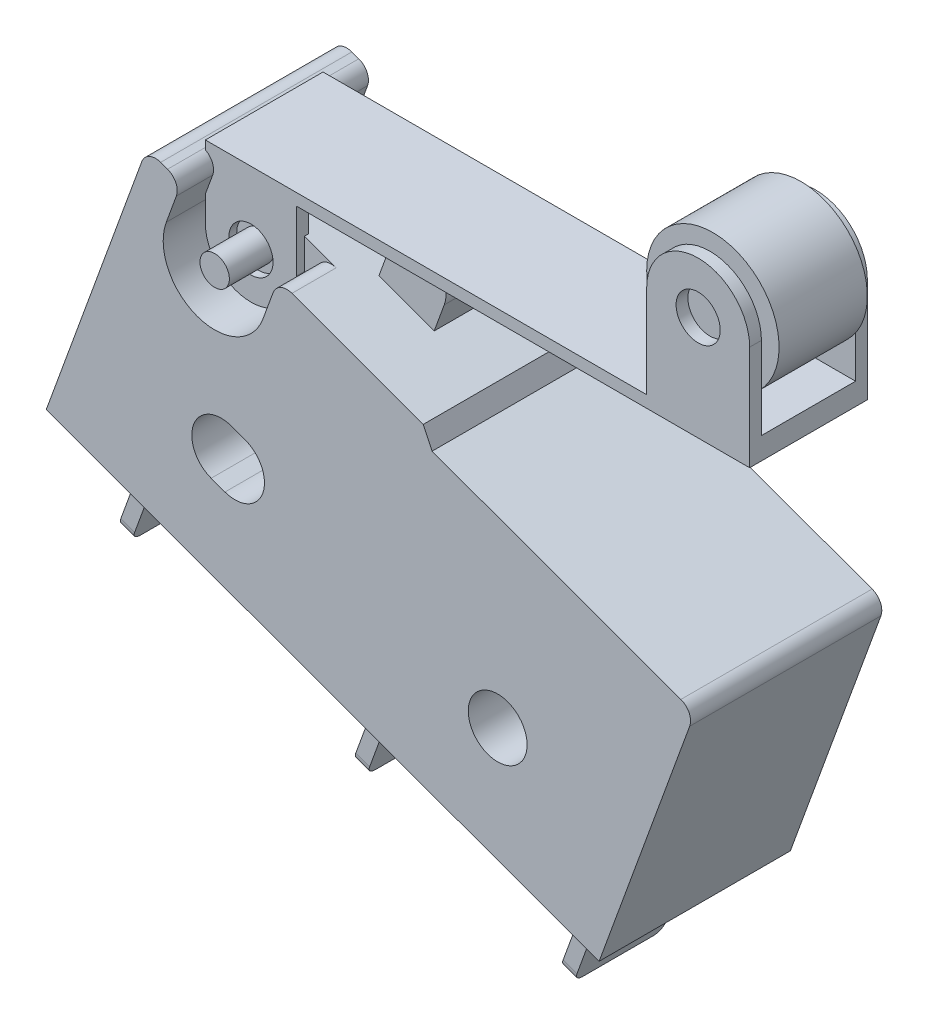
ISO-10303-21;
HEADER;
FILE_DESCRIPTION(('STEP AP214'),'2;1');
FILE_NAME('part.step','',(''),(''),'','','');
FILE_SCHEMA(('AUTOMOTIVE_DESIGN { 1 0 10303 214 1 1 1 1 }'));
ENDSEC;
DATA;
#1=APPLICATION_CONTEXT('core data for automotive mechanical design processes');
#2=APPLICATION_PROTOCOL_DEFINITION('international standard','automotive_design',2000,#1);
#3=PRODUCT_CONTEXT('',#1,'mechanical');
#4=PRODUCT('Part','Part','',(#3));
#5=PRODUCT_RELATED_PRODUCT_CATEGORY('part','',(#4));
#6=PRODUCT_DEFINITION_FORMATION('','',#4);
#7=PRODUCT_DEFINITION_CONTEXT('part definition',#1,'design');
#8=PRODUCT_DEFINITION('design','',#6,#7);
#9=PRODUCT_DEFINITION_SHAPE('','',#8);
#10=(LENGTH_UNIT() NAMED_UNIT(*) SI_UNIT(.MILLI.,.METRE.));
#11=(NAMED_UNIT(*) PLANE_ANGLE_UNIT() SI_UNIT($,.RADIAN.));
#12=(NAMED_UNIT(*) SI_UNIT($,.STERADIAN.) SOLID_ANGLE_UNIT());
#13=UNCERTAINTY_MEASURE_WITH_UNIT(LENGTH_MEASURE(1.E-05),#10,'distance_accuracy_value','');
#14=(GEOMETRIC_REPRESENTATION_CONTEXT(3) GLOBAL_UNCERTAINTY_ASSIGNED_CONTEXT((#13)) GLOBAL_UNIT_ASSIGNED_CONTEXT((#10,
#11,#12)) REPRESENTATION_CONTEXT('',''));
#15=CARTESIAN_POINT('',(0.,0.,0.));
#16=DIRECTION('',(0.,0.,1.));
#17=DIRECTION('',(1.,0.,0.));
#18=AXIS2_PLACEMENT_3D('',#15,#16,#17);
#19=CARTESIAN_POINT('',(33.9062206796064,-18.90561301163,25.7860451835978));
#20=DIRECTION('',(0.,0.,1.));
#21=DIRECTION('',(1.,0.,0.));
#22=AXIS2_PLACEMENT_3D('',#19,#20,#21);
#23=PLANE('',#22);
#24=CARTESIAN_POINT('',(33.9062206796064,-18.90561301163,25.7860451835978));
#25=DIRECTION('',(0.,0.,-1.));
#26=DIRECTION('',(-1.,0.,0.));
#27=AXIS2_PLACEMENT_3D('',#24,#25,#26);
#28=CIRCLE('',#27,2.25);
#29=CARTESIAN_POINT('',(31.6562206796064,-18.90561301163,25.7860451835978));
#30=VERTEX_POINT('',#29);
#31=EDGE_CURVE('P0_E19',#30,#30,#28,.T.);
#32=ORIENTED_EDGE('',*,*,#31,.F.);
#33=EDGE_LOOP('',(#32));
#34=FACE_BOUND('',#33,.T.);
#35=ADVANCED_FACE('P0_F16',(#34),#23,.T.);
#36=CARTESIAN_POINT('',(33.9062206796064,-18.90561301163,22.7860451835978));
#37=DIRECTION('',(0.,0.,1.));
#38=DIRECTION('',(1.,0.,0.));
#39=AXIS2_PLACEMENT_3D('',#36,#37,#38);
#40=PLANE('',#39);
#41=CARTESIAN_POINT('',(33.9062206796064,-18.90561301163,22.7860451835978));
#42=DIRECTION('',(0.,0.,-1.));
#43=DIRECTION('',(-1.,0.,0.));
#44=AXIS2_PLACEMENT_3D('',#41,#42,#43);
#45=CIRCLE('',#44,2.25);
#46=CARTESIAN_POINT('',(31.6562206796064,-18.90561301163,22.7860451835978));
#47=VERTEX_POINT('',#46);
#48=EDGE_CURVE('P0_E10',#47,#47,#45,.F.);
#49=ORIENTED_EDGE('',*,*,#48,.F.);
#50=EDGE_LOOP('',(#49));
#51=FACE_BOUND('',#50,.T.);
#52=ADVANCED_FACE('P0_F31',(#51),#40,.F.);
#53=CARTESIAN_POINT('',(33.9062206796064,-18.90561301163,25.7860451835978));
#54=DIRECTION('',(0.,0.,-1.));
#55=DIRECTION('',(-1.,0.,0.));
#56=AXIS2_PLACEMENT_3D('',#53,#54,#55);
#57=CYLINDRICAL_SURFACE('',#56,2.25);
#58=ORIENTED_EDGE('',*,*,#48,.T.);
#59=EDGE_LOOP('',(#58));
#60=FACE_BOUND('',#59,.T.);
#61=ORIENTED_EDGE('',*,*,#31,.T.);
#62=EDGE_LOOP('',(#61));
#63=FACE_BOUND('',#62,.T.);
#64=ADVANCED_FACE('P0_F28',(#60,#63),#57,.T.);
#65=CLOSED_SHELL('',(#35,#52,#64));
#66=MANIFOLD_SOLID_BREP('P0_B1',#65);
#67=CARTESIAN_POINT('',(24.086998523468,-30.1886781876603,21.0199565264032));
#68=DIRECTION('',(0.,0.,1.));
#69=DIRECTION('',(0.,-1.,0.));
#70=AXIS2_PLACEMENT_3D('',#67,#68,#69);
#71=PLANE('',#70);
#72=CARTESIAN_POINT('',(18.7062206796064,-24.50561301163,21.0199565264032));
#73=DIRECTION('',(0.,0.,-1.));
#74=DIRECTION('',(0.,1.,0.));
#75=AXIS2_PLACEMENT_3D('',#72,#73,#74);
#76=CIRCLE('',#75,0.500000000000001);
#77=CARTESIAN_POINT('',(18.7062206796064,-24.00561301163,21.0199565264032));
#78=VERTEX_POINT('',#77);
#79=EDGE_CURVE('P1_E20',#78,#78,#76,.F.);
#80=ORIENTED_EDGE('',*,*,#79,.F.);
#81=EDGE_LOOP('',(#80));
#82=FACE_BOUND('',#81,.T.);
#83=ADVANCED_FACE('P1_F17',(#82),#71,.F.);
#84=CARTESIAN_POINT('',(24.086998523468,-30.1886781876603,27.5199565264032));
#85=DIRECTION('',(0.,0.,1.));
#86=DIRECTION('',(0.,-1.,0.));
#87=AXIS2_PLACEMENT_3D('',#84,#85,#86);
#88=PLANE('',#87);
#89=CARTESIAN_POINT('',(18.7062206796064,-24.50561301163,27.5199565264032));
#90=DIRECTION('',(0.,0.,1.));
#91=DIRECTION('',(0.,-1.,0.));
#92=AXIS2_PLACEMENT_3D('',#89,#90,#91);
#93=CIRCLE('',#92,0.500000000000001);
#94=CARTESIAN_POINT('',(18.7062206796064,-25.00561301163,27.5199565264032));
#95=VERTEX_POINT('',#94);
#96=EDGE_CURVE('P1_E457',#95,#95,#93,.F.);
#97=ORIENTED_EDGE('',*,*,#96,.F.);
#98=EDGE_LOOP('',(#97));
#99=FACE_BOUND('',#98,.T.);
#100=ADVANCED_FACE('P1_F674',(#99),#88,.T.);
#101=CARTESIAN_POINT('',(12.6148073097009,-33.3559686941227,24.2699565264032));
#102=DIRECTION('',(0.939692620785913,-0.342020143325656,0.));
#103=DIRECTION('',(0.342020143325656,0.939692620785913,0.));
#104=AXIS2_PLACEMENT_3D('',#101,#102,#103);
#105=CYLINDRICAL_SURFACE('',#104,0.6);
#106=CARTESIAN_POINT('',(22.196905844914,-36.8435673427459,24.2699565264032));
#107=DIRECTION('',(0.939692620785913,-0.342020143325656,0.));
#108=DIRECTION('',(0.342020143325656,0.939692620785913,0.));
#109=AXIS2_PLACEMENT_3D('',#106,#107,#108);
#110=CIRCLE('',#109,0.6);
#111=CARTESIAN_POINT('',(22.4021179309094,-36.2797517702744,24.2699565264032));
#112=VERTEX_POINT('',#111);
#113=EDGE_CURVE('P1_E430',#112,#112,#110,.F.);
#114=ORIENTED_EDGE('',*,*,#113,.T.);
#115=EDGE_LOOP('',(#114));
#116=FACE_BOUND('',#115,.T.);
#117=CARTESIAN_POINT('',(22.6667521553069,-37.0145774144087,24.2699565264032));
#118=DIRECTION('',(0.939692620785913,-0.342020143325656,0.));
#119=DIRECTION('',(0.342020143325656,0.939692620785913,0.));
#120=AXIS2_PLACEMENT_3D('',#117,#118,#119);
#121=CIRCLE('',#120,0.6);
#122=CARTESIAN_POINT('',(22.8719642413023,-36.4507618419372,24.2699565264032));
#123=VERTEX_POINT('',#122);
#124=EDGE_CURVE('P1_E441',#123,#123,#121,.T.);
#125=ORIENTED_EDGE('',*,*,#124,.T.);
#126=EDGE_LOOP('',(#125));
#127=FACE_BOUND('',#126,.T.);
#128=ADVANCED_FACE('P1_F679',(#116,#127),#105,.F.);
#129=CARTESIAN_POINT('',(21.2824333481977,-37.8941576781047,23.0699565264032));
#130=DIRECTION('',(-0.939692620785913,0.342020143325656,0.));
#131=DIRECTION('',(-0.342020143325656,-0.939692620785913,0.));
#132=AXIS2_PLACEMENT_3D('',#129,#130,#131);
#133=CYLINDRICAL_SURFACE('',#132,0.300000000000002);
#134=CARTESIAN_POINT('',(22.2221259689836,-38.2361778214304,23.0699565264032));
#135=DIRECTION('',(-0.939692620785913,0.342020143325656,0.));
#136=DIRECTION('',(-0.342020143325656,-0.939692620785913,0.));
#137=AXIS2_PLACEMENT_3D('',#134,#135,#136);
#138=CIRCLE('',#137,0.300000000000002);
#139=CARTESIAN_POINT('',(22.2221259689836,-38.2361778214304,22.7699565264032));
#140=VERTEX_POINT('',#139);
#141=CARTESIAN_POINT('',(22.1195199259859,-38.5180856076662,23.0699565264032));
#142=VERTEX_POINT('',#141);
#143=EDGE_CURVE('P1_E437',#140,#142,#138,.T.);
#144=ORIENTED_EDGE('',*,*,#143,.T.);
#145=DIRECTION('',(0.939692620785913,-0.342020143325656,0.));
#146=VECTOR('',#145,1.);
#147=CARTESIAN_POINT('',(21.1798273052,-38.1760654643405,23.0699565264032));
#148=LINE('',#147,#146);
#149=CARTESIAN_POINT('',(21.6496736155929,-38.3470755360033,23.0699565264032));
#150=VERTEX_POINT('',#149);
#151=EDGE_CURVE('P1_E543',#150,#142,#148,.T.);
#152=ORIENTED_EDGE('',*,*,#151,.F.);
#153=CARTESIAN_POINT('',(21.7522796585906,-38.0651677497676,23.0699565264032));
#154=DIRECTION('',(-0.939692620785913,0.342020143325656,0.));
#155=DIRECTION('',(-0.342020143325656,-0.939692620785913,0.));
#156=AXIS2_PLACEMENT_3D('',#153,#154,#155);
#157=CIRCLE('',#156,0.300000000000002);
#158=CARTESIAN_POINT('',(21.7522796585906,-38.0651677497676,22.7699565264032));
#159=VERTEX_POINT('',#158);
#160=EDGE_CURVE('P1_E424',#150,#159,#157,.F.);
#161=ORIENTED_EDGE('',*,*,#160,.T.);
#162=DIRECTION('',(0.939692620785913,-0.342020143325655,0.));
#163=VECTOR('',#162,1.);
#164=CARTESIAN_POINT('',(21.7522796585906,-38.0651677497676,22.7699565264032));
#165=LINE('',#164,#163);
#166=EDGE_CURVE('P1_E561',#159,#140,#165,.T.);
#167=ORIENTED_EDGE('',*,*,#166,.T.);
#168=EDGE_LOOP('',(#144,#152,#161,#167));
#169=FACE_BOUND('',#168,.T.);
#170=ADVANCED_FACE('P1_F899',(#169),#133,.T.);
#171=CARTESIAN_POINT('',(21.6496736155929,-38.3470755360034,22.7699565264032));
#172=DIRECTION('',(0.,0.,1.));
#173=DIRECTION('',(0.,-1.,0.));
#174=AXIS2_PLACEMENT_3D('',#171,#172,#173);
#175=PLANE('',#174);
#176=ORIENTED_EDGE('',*,*,#166,.F.);
#177=DIRECTION('',(0.342020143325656,0.939692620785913,0.));
#178=VECTOR('',#177,1.);
#179=CARTESIAN_POINT('',(21.6496736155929,-38.3470755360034,22.7699565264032));
#180=LINE('',#179,#178);
#181=CARTESIAN_POINT('',(22.8467441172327,-35.0581513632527,22.7699565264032));
#182=VERTEX_POINT('',#181);
#183=EDGE_CURVE('P1_E419',#159,#182,#180,.T.);
#184=ORIENTED_EDGE('',*,*,#183,.T.);
#185=DIRECTION('',(-0.939692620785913,0.342020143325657,0.));
#186=VECTOR('',#185,1.);
#187=CARTESIAN_POINT('',(23.3165904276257,-35.2291614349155,22.7699565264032));
#188=LINE('',#187,#186);
#189=CARTESIAN_POINT('',(23.3165904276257,-35.2291614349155,22.7699565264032));
#190=VERTEX_POINT('',#189);
#191=EDGE_CURVE('P1_E570',#190,#182,#188,.T.);
#192=ORIENTED_EDGE('',*,*,#191,.F.);
#193=DIRECTION('',(-0.342020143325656,-0.939692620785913,0.));
#194=VECTOR('',#193,1.);
#195=CARTESIAN_POINT('',(22.1195199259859,-38.5180856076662,22.7699565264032));
#196=LINE('',#195,#194);
#197=EDGE_CURVE('P1_E438',#190,#140,#196,.T.);
#198=ORIENTED_EDGE('',*,*,#197,.T.);
#199=EDGE_LOOP('',(#176,#184,#192,#198));
#200=FACE_BOUND('',#199,.T.);
#201=ADVANCED_FACE('P1_F895',(#200),#175,.F.);
#202=CARTESIAN_POINT('',(21.6496736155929,-38.3470755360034,25.7699565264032));
#203=DIRECTION('',(0.,0.,-1.));
#204=DIRECTION('',(0.,1.,0.));
#205=AXIS2_PLACEMENT_3D('',#202,#203,#204);
#206=PLANE('',#205);
#207=DIRECTION('',(0.939692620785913,-0.342020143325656,0.));
#208=VECTOR('',#207,1.);
#209=CARTESIAN_POINT('',(21.2824333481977,-37.8941576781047,25.7699565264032));
#210=LINE('',#209,#208);
#211=CARTESIAN_POINT('',(22.2221259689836,-38.2361778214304,25.7699565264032));
#212=VERTEX_POINT('',#211);
#213=CARTESIAN_POINT('',(21.7522796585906,-38.0651677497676,25.7699565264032));
#214=VERTEX_POINT('',#213);
#215=EDGE_CURVE('P1_E553',#212,#214,#210,.F.);
#216=ORIENTED_EDGE('',*,*,#215,.F.);
#217=DIRECTION('',(-0.342020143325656,-0.939692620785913,0.));
#218=VECTOR('',#217,1.);
#219=CARTESIAN_POINT('',(22.1195199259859,-38.5180856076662,25.7699565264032));
#220=LINE('',#219,#218);
#221=CARTESIAN_POINT('',(23.3165904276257,-35.2291614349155,25.7699565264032));
#222=VERTEX_POINT('',#221);
#223=EDGE_CURVE('P1_E427',#212,#222,#220,.F.);
#224=ORIENTED_EDGE('',*,*,#223,.T.);
#225=DIRECTION('',(0.939692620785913,-0.342020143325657,0.));
#226=VECTOR('',#225,1.);
#227=CARTESIAN_POINT('',(22.8467441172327,-35.0581513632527,25.7699565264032));
#228=LINE('',#227,#226);
#229=CARTESIAN_POINT('',(22.8467441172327,-35.0581513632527,25.7699565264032));
#230=VERTEX_POINT('',#229);
#231=EDGE_CURVE('P1_E558',#230,#222,#228,.T.);
#232=ORIENTED_EDGE('',*,*,#231,.F.);
#233=DIRECTION('',(0.342020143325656,0.939692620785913,0.));
#234=VECTOR('',#233,1.);
#235=CARTESIAN_POINT('',(21.6496736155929,-38.3470755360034,25.7699565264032));
#236=LINE('',#235,#234);
#237=EDGE_CURVE('P1_E417',#230,#214,#236,.F.);
#238=ORIENTED_EDGE('',*,*,#237,.T.);
#239=EDGE_LOOP('',(#216,#224,#232,#238));
#240=FACE_BOUND('',#239,.T.);
#241=ADVANCED_FACE('P1_F891',(#240),#206,.F.);
#242=CARTESIAN_POINT('',(21.2824333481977,-37.8941576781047,25.4699565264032));
#243=DIRECTION('',(0.939692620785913,-0.342020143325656,0.));
#244=DIRECTION('',(0.342020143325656,0.939692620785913,0.));
#245=AXIS2_PLACEMENT_3D('',#242,#243,#244);
#246=CYLINDRICAL_SURFACE('',#245,0.300000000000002);
#247=CARTESIAN_POINT('',(21.7522796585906,-38.0651677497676,25.4699565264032));
#248=DIRECTION('',(0.939692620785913,-0.342020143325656,0.));
#249=DIRECTION('',(0.342020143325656,0.939692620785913,0.));
#250=AXIS2_PLACEMENT_3D('',#247,#248,#249);
#251=CIRCLE('',#250,0.300000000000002);
#252=CARTESIAN_POINT('',(21.6496736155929,-38.3470755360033,25.4699565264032));
#253=VERTEX_POINT('',#252);
#254=EDGE_CURVE('P1_E416',#214,#253,#251,.T.);
#255=ORIENTED_EDGE('',*,*,#254,.T.);
#256=DIRECTION('',(0.939692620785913,-0.342020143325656,0.));
#257=VECTOR('',#256,1.);
#258=CARTESIAN_POINT('',(21.1798273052,-38.1760654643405,25.4699565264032));
#259=LINE('',#258,#257);
#260=CARTESIAN_POINT('',(22.1195199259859,-38.5180856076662,25.4699565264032));
#261=VERTEX_POINT('',#260);
#262=EDGE_CURVE('P1_E550',#261,#253,#259,.F.);
#263=ORIENTED_EDGE('',*,*,#262,.F.);
#264=CARTESIAN_POINT('',(22.2221259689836,-38.2361778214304,25.4699565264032));
#265=DIRECTION('',(0.939692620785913,-0.342020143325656,0.));
#266=DIRECTION('',(0.342020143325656,0.939692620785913,0.));
#267=AXIS2_PLACEMENT_3D('',#264,#265,#266);
#268=CIRCLE('',#267,0.300000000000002);
#269=EDGE_CURVE('P1_E431',#261,#212,#268,.F.);
#270=ORIENTED_EDGE('',*,*,#269,.T.);
#271=ORIENTED_EDGE('',*,*,#215,.T.);
#272=EDGE_LOOP('',(#255,#263,#270,#271));
#273=FACE_BOUND('',#272,.T.);
#274=ADVANCED_FACE('P1_F887',(#273),#246,.T.);
#275=CARTESIAN_POINT('',(21.1798273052,-38.1760654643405,24.2699565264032));
#276=DIRECTION('',(-0.342020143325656,-0.939692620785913,0.));
#277=DIRECTION('',(0.939692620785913,-0.342020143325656,0.));
#278=AXIS2_PLACEMENT_3D('',#275,#276,#277);
#279=PLANE('',#278);
#280=DIRECTION('',(0.,0.,1.));
#281=VECTOR('',#280,1.);
#282=CARTESIAN_POINT('',(21.6496736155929,-38.3470755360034,25.7699565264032));
#283=LINE('',#282,#281);
#284=EDGE_CURVE('P1_E412',#253,#150,#283,.F.);
#285=ORIENTED_EDGE('',*,*,#284,.T.);
#286=ORIENTED_EDGE('',*,*,#151,.T.);
#287=DIRECTION('',(0.,0.,1.));
#288=VECTOR('',#287,1.);
#289=CARTESIAN_POINT('',(22.1195199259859,-38.5180856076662,25.7699565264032));
#290=LINE('',#289,#288);
#291=EDGE_CURVE('P1_E434',#142,#261,#290,.T.);
#292=ORIENTED_EDGE('',*,*,#291,.T.);
#293=ORIENTED_EDGE('',*,*,#262,.T.);
#294=EDGE_LOOP('',(#285,#286,#292,#293));
#295=FACE_BOUND('',#294,.T.);
#296=ADVANCED_FACE('P1_F883',(#295),#279,.T.);
#297=CARTESIAN_POINT('',(12.6148073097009,-33.3559686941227,24.2699565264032));
#298=DIRECTION('',(0.939692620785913,-0.342020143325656,0.));
#299=DIRECTION('',(0.342020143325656,0.939692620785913,0.));
#300=AXIS2_PLACEMENT_3D('',#297,#298,#299);
#301=CYLINDRICAL_SURFACE('',#300,0.6);
#302=CARTESIAN_POINT('',(14.6793648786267,-34.1074061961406,24.2699565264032));
#303=DIRECTION('',(0.939692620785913,-0.342020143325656,0.));
#304=DIRECTION('',(0.342020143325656,0.939692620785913,0.));
#305=AXIS2_PLACEMENT_3D('',#302,#303,#304);
#306=CIRCLE('',#305,0.6);
#307=CARTESIAN_POINT('',(14.8845769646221,-33.5435906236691,24.2699565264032));
#308=VERTEX_POINT('',#307);
#309=EDGE_CURVE('P1_E415',#308,#308,#306,.T.);
#310=ORIENTED_EDGE('',*,*,#309,.T.);
#311=EDGE_LOOP('',(#310));
#312=FACE_BOUND('',#311,.T.);
#313=CARTESIAN_POINT('',(14.2095185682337,-33.9363961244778,24.2699565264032));
#314=DIRECTION('',(0.939692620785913,-0.342020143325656,0.));
#315=DIRECTION('',(0.342020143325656,0.939692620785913,0.));
#316=AXIS2_PLACEMENT_3D('',#313,#314,#315);
#317=CIRCLE('',#316,0.6);
#318=CARTESIAN_POINT('',(14.4147306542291,-33.3725805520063,24.2699565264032));
#319=VERTEX_POINT('',#318);
#320=EDGE_CURVE('P1_E387',#319,#319,#317,.F.);
#321=ORIENTED_EDGE('',*,*,#320,.T.);
#322=EDGE_LOOP('',(#321));
#323=FACE_BOUND('',#322,.T.);
#324=ADVANCED_FACE('P1_F879',(#312,#323),#301,.F.);
#325=CARTESIAN_POINT('',(13.6622863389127,-35.4399043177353,25.7699565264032));
#326=DIRECTION('',(0.,0.,-1.));
#327=DIRECTION('',(-1.,0.,0.));
#328=AXIS2_PLACEMENT_3D('',#325,#326,#327);
#329=PLANE('',#328);
#330=DIRECTION('',(0.939692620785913,-0.342020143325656,0.));
#331=VECTOR('',#330,1.);
#332=CARTESIAN_POINT('',(21.2824333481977,-37.8941576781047,25.7699565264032));
#333=LINE('',#332,#331);
#334=CARTESIAN_POINT('',(14.2347386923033,-35.3290066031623,25.7699565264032));
#335=VERTEX_POINT('',#334);
#336=CARTESIAN_POINT('',(13.7648923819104,-35.1579965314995,25.7699565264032));
#337=VERTEX_POINT('',#336);
#338=EDGE_CURVE('P1_E537',#335,#337,#333,.F.);
#339=ORIENTED_EDGE('',*,*,#338,.F.);
#340=DIRECTION('',(-0.342020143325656,-0.939692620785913,0.));
#341=VECTOR('',#340,1.);
#342=CARTESIAN_POINT('',(14.1321326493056,-35.6109143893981,25.7699565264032));
#343=LINE('',#342,#341);
#344=CARTESIAN_POINT('',(15.3292031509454,-32.3219902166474,25.7699565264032));
#345=VERTEX_POINT('',#344);
#346=EDGE_CURVE('P1_E397',#335,#345,#343,.F.);
#347=ORIENTED_EDGE('',*,*,#346,.T.);
#348=DIRECTION('',(0.939692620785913,-0.342020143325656,0.));
#349=VECTOR('',#348,1.);
#350=CARTESIAN_POINT('',(14.8593568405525,-32.1509801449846,25.7699565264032));
#351=LINE('',#350,#349);
#352=CARTESIAN_POINT('',(14.8593568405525,-32.1509801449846,25.7699565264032));
#353=VERTEX_POINT('',#352);
#354=EDGE_CURVE('P1_E540',#353,#345,#351,.T.);
#355=ORIENTED_EDGE('',*,*,#354,.F.);
#356=DIRECTION('',(0.342020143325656,0.939692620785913,0.));
#357=VECTOR('',#356,1.);
#358=CARTESIAN_POINT('',(13.6622863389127,-35.4399043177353,25.7699565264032));
#359=LINE('',#358,#357);
#360=EDGE_CURVE('P1_E385',#353,#337,#359,.F.);
#361=ORIENTED_EDGE('',*,*,#360,.T.);
#362=EDGE_LOOP('',(#339,#347,#355,#361));
#363=FACE_BOUND('',#362,.T.);
#364=ADVANCED_FACE('P1_F875',(#363),#329,.F.);
#365=CARTESIAN_POINT('',(21.2824333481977,-37.8941576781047,25.4699565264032));
#366=DIRECTION('',(0.939692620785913,-0.342020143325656,0.));
#367=DIRECTION('',(0.342020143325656,0.939692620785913,0.));
#368=AXIS2_PLACEMENT_3D('',#365,#366,#367);
#369=CYLINDRICAL_SURFACE('',#368,0.300000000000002);
#370=CARTESIAN_POINT('',(13.7648923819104,-35.1579965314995,25.4699565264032));
#371=DIRECTION('',(0.939692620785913,-0.342020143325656,0.));
#372=DIRECTION('',(0.342020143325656,0.939692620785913,0.));
#373=AXIS2_PLACEMENT_3D('',#370,#371,#372);
#374=CIRCLE('',#373,0.300000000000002);
#375=CARTESIAN_POINT('',(13.6622863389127,-35.4399043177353,25.4699565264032));
#376=VERTEX_POINT('',#375);
#377=EDGE_CURVE('P1_E384',#337,#376,#374,.T.);
#378=ORIENTED_EDGE('',*,*,#377,.T.);
#379=DIRECTION('',(0.939692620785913,-0.342020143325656,0.));
#380=VECTOR('',#379,1.);
#381=CARTESIAN_POINT('',(21.1798273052,-38.1760654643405,25.4699565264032));
#382=LINE('',#381,#380);
#383=CARTESIAN_POINT('',(14.1321326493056,-35.6109143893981,25.4699565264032));
#384=VERTEX_POINT('',#383);
#385=EDGE_CURVE('P1_E534',#384,#376,#382,.F.);
#386=ORIENTED_EDGE('',*,*,#385,.F.);
#387=CARTESIAN_POINT('',(14.2347386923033,-35.3290066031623,25.4699565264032));
#388=DIRECTION('',(0.939692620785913,-0.342020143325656,0.));
#389=DIRECTION('',(0.342020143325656,0.939692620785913,0.));
#390=AXIS2_PLACEMENT_3D('',#387,#388,#389);
#391=CIRCLE('',#390,0.300000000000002);
#392=EDGE_CURVE('P1_E402',#384,#335,#391,.F.);
#393=ORIENTED_EDGE('',*,*,#392,.T.);
#394=ORIENTED_EDGE('',*,*,#338,.T.);
#395=EDGE_LOOP('',(#378,#386,#393,#394));
#396=FACE_BOUND('',#395,.T.);
#397=ADVANCED_FACE('P1_F871',(#396),#369,.T.);
#398=CARTESIAN_POINT('',(21.1798273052,-38.1760654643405,24.2699565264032));
#399=DIRECTION('',(-0.342020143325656,-0.939692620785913,0.));
#400=DIRECTION('',(0.939692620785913,-0.342020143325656,0.));
#401=AXIS2_PLACEMENT_3D('',#398,#399,#400);
#402=PLANE('',#401);
#403=DIRECTION('',(0.,0.,1.));
#404=VECTOR('',#403,1.);
#405=CARTESIAN_POINT('',(14.1321326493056,-35.6109143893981,25.7699565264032));
#406=LINE('',#405,#404);
#407=CARTESIAN_POINT('',(14.1321326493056,-35.6109143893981,23.0699565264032));
#408=VERTEX_POINT('',#407);
#409=EDGE_CURVE('P1_E390',#408,#384,#406,.T.);
#410=ORIENTED_EDGE('',*,*,#409,.T.);
#411=ORIENTED_EDGE('',*,*,#385,.T.);
#412=DIRECTION('',(0.,0.,1.));
#413=VECTOR('',#412,1.);
#414=CARTESIAN_POINT('',(13.6622863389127,-35.4399043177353,25.7699565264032));
#415=LINE('',#414,#413);
#416=CARTESIAN_POINT('',(13.6622863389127,-35.4399043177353,23.0699565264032));
#417=VERTEX_POINT('',#416);
#418=EDGE_CURVE('P1_E382',#376,#417,#415,.F.);
#419=ORIENTED_EDGE('',*,*,#418,.T.);
#420=DIRECTION('',(-0.939692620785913,0.342020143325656,0.));
#421=VECTOR('',#420,1.);
#422=CARTESIAN_POINT('',(21.1798273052,-38.1760654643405,23.0699565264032));
#423=LINE('',#422,#421);
#424=EDGE_CURVE('P1_E524',#408,#417,#423,.T.);
#425=ORIENTED_EDGE('',*,*,#424,.F.);
#426=EDGE_LOOP('',(#410,#411,#419,#425));
#427=FACE_BOUND('',#426,.T.);
#428=ADVANCED_FACE('P1_F867',(#427),#402,.T.);
#429=CARTESIAN_POINT('',(21.2824333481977,-37.8941576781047,23.0699565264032));
#430=DIRECTION('',(-0.939692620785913,0.342020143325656,0.));
#431=DIRECTION('',(-0.342020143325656,-0.939692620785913,0.));
#432=AXIS2_PLACEMENT_3D('',#429,#430,#431);
#433=CYLINDRICAL_SURFACE('',#432,0.300000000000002);
#434=CARTESIAN_POINT('',(14.2347386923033,-35.3290066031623,23.0699565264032));
#435=DIRECTION('',(-0.939692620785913,0.342020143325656,0.));
#436=DIRECTION('',(-0.342020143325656,-0.939692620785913,0.));
#437=AXIS2_PLACEMENT_3D('',#434,#435,#436);
#438=CIRCLE('',#437,0.300000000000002);
#439=CARTESIAN_POINT('',(14.2347386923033,-35.3290066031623,22.7699565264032));
#440=VERTEX_POINT('',#439);
#441=EDGE_CURVE('P1_E393',#440,#408,#438,.T.);
#442=ORIENTED_EDGE('',*,*,#441,.T.);
#443=ORIENTED_EDGE('',*,*,#424,.T.);
#444=CARTESIAN_POINT('',(13.7648923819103,-35.1579965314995,23.0699565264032));
#445=DIRECTION('',(-0.939692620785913,0.342020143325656,0.));
#446=DIRECTION('',(-0.342020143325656,-0.939692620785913,0.));
#447=AXIS2_PLACEMENT_3D('',#444,#445,#446);
#448=CIRCLE('',#447,0.300000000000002);
#449=CARTESIAN_POINT('',(13.7648923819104,-35.1579965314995,22.7699565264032));
#450=VERTEX_POINT('',#449);
#451=EDGE_CURVE('P1_E379',#417,#450,#448,.F.);
#452=ORIENTED_EDGE('',*,*,#451,.T.);
#453=DIRECTION('',(0.939692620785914,-0.342020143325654,0.));
#454=VECTOR('',#453,1.);
#455=CARTESIAN_POINT('',(13.7648923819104,-35.1579965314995,22.7699565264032));
#456=LINE('',#455,#454);
#457=EDGE_CURVE('P1_E512',#450,#440,#456,.T.);
#458=ORIENTED_EDGE('',*,*,#457,.T.);
#459=EDGE_LOOP('',(#442,#443,#452,#458));
#460=FACE_BOUND('',#459,.T.);
#461=ADVANCED_FACE('P1_F863',(#460),#433,.T.);
#462=CARTESIAN_POINT('',(13.6622863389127,-35.4399043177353,22.7699565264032));
#463=DIRECTION('',(0.,0.,1.));
#464=DIRECTION('',(0.,-1.,0.));
#465=AXIS2_PLACEMENT_3D('',#462,#463,#464);
#466=PLANE('',#465);
#467=ORIENTED_EDGE('',*,*,#457,.F.);
#468=DIRECTION('',(0.342020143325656,0.939692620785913,0.));
#469=VECTOR('',#468,1.);
#470=CARTESIAN_POINT('',(13.6622863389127,-35.4399043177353,22.7699565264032));
#471=LINE('',#470,#469);
#472=CARTESIAN_POINT('',(14.8593568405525,-32.1509801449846,22.7699565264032));
#473=VERTEX_POINT('',#472);
#474=EDGE_CURVE('P1_E375',#450,#473,#471,.T.);
#475=ORIENTED_EDGE('',*,*,#474,.T.);
#476=DIRECTION('',(-0.939692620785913,0.342020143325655,0.));
#477=VECTOR('',#476,1.);
#478=CARTESIAN_POINT('',(15.3292031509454,-32.3219902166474,22.7699565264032));
#479=LINE('',#478,#477);
#480=CARTESIAN_POINT('',(15.3292031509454,-32.3219902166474,22.7699565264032));
#481=VERTEX_POINT('',#480);
#482=EDGE_CURVE('P1_E521',#481,#473,#479,.T.);
#483=ORIENTED_EDGE('',*,*,#482,.F.);
#484=DIRECTION('',(-0.342020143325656,-0.939692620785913,0.));
#485=VECTOR('',#484,1.);
#486=CARTESIAN_POINT('',(14.1321326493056,-35.6109143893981,22.7699565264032));
#487=LINE('',#486,#485);
#488=EDGE_CURVE('P1_E394',#481,#440,#487,.T.);
#489=ORIENTED_EDGE('',*,*,#488,.T.);
#490=EDGE_LOOP('',(#467,#475,#483,#489));
#491=FACE_BOUND('',#490,.T.);
#492=ADVANCED_FACE('P1_F859',(#491),#466,.F.);
#493=CARTESIAN_POINT('',(12.6148073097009,-33.3559686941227,24.2699565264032));
#494=DIRECTION('',(0.939692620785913,-0.342020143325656,0.));
#495=DIRECTION('',(0.342020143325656,0.939692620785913,0.));
#496=AXIS2_PLACEMENT_3D('',#493,#494,#495);
#497=CYLINDRICAL_SURFACE('',#496,0.6);
#498=CARTESIAN_POINT('',(29.2446005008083,-39.4087184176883,24.2699565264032));
#499=DIRECTION('',(0.939692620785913,-0.342020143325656,0.));
#500=DIRECTION('',(0.342020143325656,0.939692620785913,0.));
#501=AXIS2_PLACEMENT_3D('',#498,#499,#500);
#502=CIRCLE('',#501,0.6);
#503=CARTESIAN_POINT('',(29.4498125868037,-38.8449028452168,24.2699565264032));
#504=VERTEX_POINT('',#503);
#505=EDGE_CURVE('P1_E357',#504,#504,#502,.F.);
#506=ORIENTED_EDGE('',*,*,#505,.T.);
#507=EDGE_LOOP('',(#506));
#508=FACE_BOUND('',#507,.T.);
#509=CARTESIAN_POINT('',(29.7144468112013,-39.5797284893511,24.2699565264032));
#510=DIRECTION('',(0.939692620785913,-0.342020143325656,0.));
#511=DIRECTION('',(0.342020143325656,0.939692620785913,0.));
#512=AXIS2_PLACEMENT_3D('',#509,#510,#511);
#513=CIRCLE('',#512,0.6);
#514=CARTESIAN_POINT('',(29.9196588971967,-39.0159129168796,24.2699565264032));
#515=VERTEX_POINT('',#514);
#516=EDGE_CURVE('P1_E378',#515,#515,#513,.T.);
#517=ORIENTED_EDGE('',*,*,#516,.T.);
#518=EDGE_LOOP('',(#517));
#519=FACE_BOUND('',#518,.T.);
#520=ADVANCED_FACE('P1_F855',(#508,#519),#497,.F.);
#521=CARTESIAN_POINT('',(28.6973682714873,-40.9122266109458,25.7699565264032));
#522=DIRECTION('',(0.,0.,-1.));
#523=DIRECTION('',(-1.,0.,0.));
#524=AXIS2_PLACEMENT_3D('',#521,#522,#523);
#525=PLANE('',#524);
#526=DIRECTION('',(0.939692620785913,-0.342020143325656,0.));
#527=VECTOR('',#526,1.);
#528=CARTESIAN_POINT('',(21.2824333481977,-37.8941576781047,25.7699565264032));
#529=LINE('',#528,#527);
#530=CARTESIAN_POINT('',(29.2698206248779,-40.8013288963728,25.7699565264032));
#531=VERTEX_POINT('',#530);
#532=CARTESIAN_POINT('',(28.799974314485,-40.63031882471,25.7699565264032));
#533=VERTEX_POINT('',#532);
#534=EDGE_CURVE('P1_E506',#531,#533,#529,.F.);
#535=ORIENTED_EDGE('',*,*,#534,.F.);
#536=DIRECTION('',(-0.342020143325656,-0.939692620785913,0.));
#537=VECTOR('',#536,1.);
#538=CARTESIAN_POINT('',(29.1672145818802,-41.0832366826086,25.7699565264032));
#539=LINE('',#538,#537);
#540=CARTESIAN_POINT('',(30.36428508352,-37.7943125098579,25.7699565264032));
#541=VERTEX_POINT('',#540);
#542=EDGE_CURVE('P1_E367',#531,#541,#539,.F.);
#543=ORIENTED_EDGE('',*,*,#542,.T.);
#544=DIRECTION('',(0.939692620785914,-0.342020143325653,0.));
#545=VECTOR('',#544,1.);
#546=CARTESIAN_POINT('',(29.8944387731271,-37.6233024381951,25.7699565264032));
#547=LINE('',#546,#545);
#548=CARTESIAN_POINT('',(29.8944387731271,-37.6233024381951,25.7699565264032));
#549=VERTEX_POINT('',#548);
#550=EDGE_CURVE('P1_E509',#549,#541,#547,.T.);
#551=ORIENTED_EDGE('',*,*,#550,.F.);
#552=DIRECTION('',(0.342020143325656,0.939692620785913,0.));
#553=VECTOR('',#552,1.);
#554=CARTESIAN_POINT('',(28.6973682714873,-40.9122266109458,25.7699565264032));
#555=LINE('',#554,#553);
#556=EDGE_CURVE('P1_E355',#549,#533,#555,.F.);
#557=ORIENTED_EDGE('',*,*,#556,.T.);
#558=EDGE_LOOP('',(#535,#543,#551,#557));
#559=FACE_BOUND('',#558,.T.);
#560=ADVANCED_FACE('P1_F851',(#559),#525,.F.);
#561=CARTESIAN_POINT('',(21.2824333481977,-37.8941576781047,25.4699565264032));
#562=DIRECTION('',(0.939692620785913,-0.342020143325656,0.));
#563=DIRECTION('',(0.342020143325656,0.939692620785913,0.));
#564=AXIS2_PLACEMENT_3D('',#561,#562,#563);
#565=CYLINDRICAL_SURFACE('',#564,0.300000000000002);
#566=CARTESIAN_POINT('',(28.799974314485,-40.63031882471,25.4699565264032));
#567=DIRECTION('',(0.939692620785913,-0.342020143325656,0.));
#568=DIRECTION('',(0.342020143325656,0.939692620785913,0.));
#569=AXIS2_PLACEMENT_3D('',#566,#567,#568);
#570=CIRCLE('',#569,0.300000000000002);
#571=CARTESIAN_POINT('',(28.6973682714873,-40.9122266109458,25.4699565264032));
#572=VERTEX_POINT('',#571);
#573=EDGE_CURVE('P1_E354',#533,#572,#570,.T.);
#574=ORIENTED_EDGE('',*,*,#573,.T.);
#575=DIRECTION('',(0.939692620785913,-0.342020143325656,0.));
#576=VECTOR('',#575,1.);
#577=CARTESIAN_POINT('',(21.1798273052,-38.1760654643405,25.4699565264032));
#578=LINE('',#577,#576);
#579=CARTESIAN_POINT('',(29.1672145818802,-41.0832366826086,25.4699565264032));
#580=VERTEX_POINT('',#579);
#581=EDGE_CURVE('P1_E503',#580,#572,#578,.F.);
#582=ORIENTED_EDGE('',*,*,#581,.F.);
#583=CARTESIAN_POINT('',(29.2698206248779,-40.8013288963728,25.4699565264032));
#584=DIRECTION('',(0.939692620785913,-0.342020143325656,0.));
#585=DIRECTION('',(0.342020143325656,0.939692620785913,0.));
#586=AXIS2_PLACEMENT_3D('',#583,#584,#585);
#587=CIRCLE('',#586,0.300000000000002);
#588=EDGE_CURVE('P1_E372',#580,#531,#587,.F.);
#589=ORIENTED_EDGE('',*,*,#588,.T.);
#590=ORIENTED_EDGE('',*,*,#534,.T.);
#591=EDGE_LOOP('',(#574,#582,#589,#590));
#592=FACE_BOUND('',#591,.T.);
#593=ADVANCED_FACE('P1_F847',(#592),#565,.T.);
#594=CARTESIAN_POINT('',(21.1798273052,-38.1760654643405,24.2699565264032));
#595=DIRECTION('',(-0.342020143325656,-0.939692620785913,0.));
#596=DIRECTION('',(0.939692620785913,-0.342020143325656,0.));
#597=AXIS2_PLACEMENT_3D('',#594,#595,#596);
#598=PLANE('',#597);
#599=DIRECTION('',(0.,0.,1.));
#600=VECTOR('',#599,1.);
#601=CARTESIAN_POINT('',(29.1672145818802,-41.0832366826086,25.7699565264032));
#602=LINE('',#601,#600);
#603=CARTESIAN_POINT('',(29.1672145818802,-41.0832366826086,23.0699565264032));
#604=VERTEX_POINT('',#603);
#605=EDGE_CURVE('P1_E360',#604,#580,#602,.T.);
#606=ORIENTED_EDGE('',*,*,#605,.T.);
#607=ORIENTED_EDGE('',*,*,#581,.T.);
#608=DIRECTION('',(0.,0.,1.));
#609=VECTOR('',#608,1.);
#610=CARTESIAN_POINT('',(28.6973682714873,-40.9122266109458,25.7699565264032));
#611=LINE('',#610,#609);
#612=CARTESIAN_POINT('',(28.6973682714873,-40.9122266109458,23.0699565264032));
#613=VERTEX_POINT('',#612);
#614=EDGE_CURVE('P1_E352',#572,#613,#611,.F.);
#615=ORIENTED_EDGE('',*,*,#614,.T.);
#616=DIRECTION('',(-0.939692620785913,0.342020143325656,0.));
#617=VECTOR('',#616,1.);
#618=CARTESIAN_POINT('',(21.1798273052,-38.1760654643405,23.0699565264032));
#619=LINE('',#618,#617);
#620=EDGE_CURVE('P1_E491',#604,#613,#619,.T.);
#621=ORIENTED_EDGE('',*,*,#620,.F.);
#622=EDGE_LOOP('',(#606,#607,#615,#621));
#623=FACE_BOUND('',#622,.T.);
#624=ADVANCED_FACE('P1_F843',(#623),#598,.T.);
#625=CARTESIAN_POINT('',(21.2824333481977,-37.8941576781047,23.0699565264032));
#626=DIRECTION('',(-0.939692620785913,0.342020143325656,0.));
#627=DIRECTION('',(-0.342020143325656,-0.939692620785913,0.));
#628=AXIS2_PLACEMENT_3D('',#625,#626,#627);
#629=CYLINDRICAL_SURFACE('',#628,0.300000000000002);
#630=CARTESIAN_POINT('',(29.2698206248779,-40.8013288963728,23.0699565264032));
#631=DIRECTION('',(-0.939692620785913,0.342020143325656,0.));
#632=DIRECTION('',(-0.342020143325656,-0.939692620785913,0.));
#633=AXIS2_PLACEMENT_3D('',#630,#631,#632);
#634=CIRCLE('',#633,0.300000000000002);
#635=CARTESIAN_POINT('',(29.2698206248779,-40.8013288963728,22.7699565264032));
#636=VERTEX_POINT('',#635);
#637=EDGE_CURVE('P1_E363',#636,#604,#634,.T.);
#638=ORIENTED_EDGE('',*,*,#637,.T.);
#639=ORIENTED_EDGE('',*,*,#620,.T.);
#640=CARTESIAN_POINT('',(28.799974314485,-40.63031882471,23.0699565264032));
#641=DIRECTION('',(-0.939692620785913,0.342020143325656,0.));
#642=DIRECTION('',(-0.342020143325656,-0.939692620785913,0.));
#643=AXIS2_PLACEMENT_3D('',#640,#641,#642);
#644=CIRCLE('',#643,0.300000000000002);
#645=CARTESIAN_POINT('',(28.799974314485,-40.63031882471,22.7699565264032));
#646=VERTEX_POINT('',#645);
#647=EDGE_CURVE('P1_E349',#613,#646,#644,.F.);
#648=ORIENTED_EDGE('',*,*,#647,.T.);
#649=DIRECTION('',(0.939692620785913,-0.342020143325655,0.));
#650=VECTOR('',#649,1.);
#651=CARTESIAN_POINT('',(28.799974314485,-40.63031882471,22.7699565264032));
#652=LINE('',#651,#650);
#653=EDGE_CURVE('P1_E486',#646,#636,#652,.T.);
#654=ORIENTED_EDGE('',*,*,#653,.T.);
#655=EDGE_LOOP('',(#638,#639,#648,#654));
#656=FACE_BOUND('',#655,.T.);
#657=ADVANCED_FACE('P1_F839',(#656),#629,.T.);
#658=CARTESIAN_POINT('',(28.6973682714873,-40.9122266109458,22.7699565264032));
#659=DIRECTION('',(0.,0.,1.));
#660=DIRECTION('',(0.,-1.,0.));
#661=AXIS2_PLACEMENT_3D('',#658,#659,#660);
#662=PLANE('',#661);
#663=ORIENTED_EDGE('',*,*,#653,.F.);
#664=DIRECTION('',(0.342020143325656,0.939692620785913,0.));
#665=VECTOR('',#664,1.);
#666=CARTESIAN_POINT('',(28.6973682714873,-40.9122266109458,22.7699565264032));
#667=LINE('',#666,#665);
#668=CARTESIAN_POINT('',(29.8944387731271,-37.6233024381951,22.7699565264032));
#669=VERTEX_POINT('',#668);
#670=EDGE_CURVE('P1_E345',#646,#669,#667,.T.);
#671=ORIENTED_EDGE('',*,*,#670,.T.);
#672=DIRECTION('',(-0.939692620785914,0.342020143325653,0.));
#673=VECTOR('',#672,1.);
#674=CARTESIAN_POINT('',(30.36428508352,-37.7943125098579,22.7699565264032));
#675=LINE('',#674,#673);
#676=CARTESIAN_POINT('',(30.36428508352,-37.7943125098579,22.7699565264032));
#677=VERTEX_POINT('',#676);
#678=EDGE_CURVE('P1_E488',#677,#669,#675,.T.);
#679=ORIENTED_EDGE('',*,*,#678,.F.);
#680=DIRECTION('',(-0.342020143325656,-0.939692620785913,0.));
#681=VECTOR('',#680,1.);
#682=CARTESIAN_POINT('',(29.1672145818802,-41.0832366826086,22.7699565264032));
#683=LINE('',#682,#681);
#684=EDGE_CURVE('P1_E364',#677,#636,#683,.T.);
#685=ORIENTED_EDGE('',*,*,#684,.T.);
#686=EDGE_LOOP('',(#663,#671,#679,#685));
#687=FACE_BOUND('',#686,.T.);
#688=ADVANCED_FACE('P1_F836',(#687),#662,.F.);
#689=CARTESIAN_POINT('',(18.7062206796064,-24.50561301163,22.5199565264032));
#690=DIRECTION('',(0.,0.,-1.));
#691=DIRECTION('',(0.,1.,0.));
#692=AXIS2_PLACEMENT_3D('',#689,#690,#691);
#693=CYLINDRICAL_SURFACE('',#692,0.500000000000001);
#694=ORIENTED_EDGE('',*,*,#79,.T.);
#695=EDGE_LOOP('',(#694));
#696=FACE_BOUND('',#695,.T.);
#697=CARTESIAN_POINT('',(18.7062206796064,-24.50561301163,22.5199565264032));
#698=DIRECTION('',(0.,0.,-1.));
#699=DIRECTION('',(0.,1.,0.));
#700=AXIS2_PLACEMENT_3D('',#697,#698,#699);
#701=CIRCLE('',#700,0.500000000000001);
#702=CARTESIAN_POINT('',(18.7062206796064,-24.00561301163,22.5199565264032));
#703=VERTEX_POINT('',#702);
#704=EDGE_CURVE('P1_E320',#703,#703,#701,.F.);
#705=ORIENTED_EDGE('',*,*,#704,.F.);
#706=EDGE_LOOP('',(#705));
#707=FACE_BOUND('',#706,.T.);
#708=ADVANCED_FACE('P1_F670',(#696,#707),#693,.T.);
#709=CARTESIAN_POINT('',(23.3200415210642,-23.5244620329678,23.2699565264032));
#710=DIRECTION('',(0.,0.,1.));
#711=DIRECTION('',(0.,-1.,0.));
#712=AXIS2_PLACEMENT_3D('',#709,#710,#711);
#713=CYLINDRICAL_SURFACE('',#712,1.);
#714=CARTESIAN_POINT('',(23.3200415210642,-23.5244620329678,23.2699565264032));
#715=DIRECTION('',(0.,0.,1.));
#716=DIRECTION('',(0.,-1.,0.));
#717=AXIS2_PLACEMENT_3D('',#714,#715,#716);
#718=CIRCLE('',#717,1.);
#719=CARTESIAN_POINT('',(24.2597341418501,-23.8664821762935,23.2699565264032));
#720=VERTEX_POINT('',#719);
#721=CARTESIAN_POINT('',(22.3803489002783,-23.1824418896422,23.2699565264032));
#722=VERTEX_POINT('',#721);
#723=EDGE_CURVE('P1_E264',#720,#722,#718,.T.);
#724=ORIENTED_EDGE('',*,*,#723,.T.);
#725=DIRECTION('',(0.,0.,1.));
#726=VECTOR('',#725,1.);
#727=CARTESIAN_POINT('',(22.3803489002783,-23.1824418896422,23.2699565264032));
#728=LINE('',#727,#726);
#729=CARTESIAN_POINT('',(22.3803489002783,-23.1824418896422,25.2699565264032));
#730=VERTEX_POINT('',#729);
#731=EDGE_CURVE('P1_E259',#722,#730,#728,.T.);
#732=ORIENTED_EDGE('',*,*,#731,.T.);
#733=CARTESIAN_POINT('',(23.3200415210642,-23.5244620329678,25.2699565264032));
#734=DIRECTION('',(0.,0.,1.));
#735=DIRECTION('',(0.,-1.,0.));
#736=AXIS2_PLACEMENT_3D('',#733,#734,#735);
#737=CIRCLE('',#736,1.);
#738=CARTESIAN_POINT('',(24.2597341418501,-23.8664821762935,25.2699565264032));
#739=VERTEX_POINT('',#738);
#740=EDGE_CURVE('P1_E246',#739,#730,#737,.T.);
#741=ORIENTED_EDGE('',*,*,#740,.F.);
#742=DIRECTION('',(0.,0.,1.));
#743=VECTOR('',#742,1.);
#744=CARTESIAN_POINT('',(24.2597341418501,-23.8664821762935,23.2699565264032));
#745=LINE('',#744,#743);
#746=EDGE_CURVE('P1_E275',#739,#720,#745,.F.);
#747=ORIENTED_EDGE('',*,*,#746,.T.);
#748=EDGE_LOOP('',(#724,#732,#741,#747));
#749=FACE_BOUND('',#748,.T.);
#750=ADVANCED_FACE('P1_F263',(#749),#713,.T.);
#751=CARTESIAN_POINT('',(18.7062206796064,-24.50561301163,26.0199565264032));
#752=DIRECTION('',(0.,0.,1.));
#753=DIRECTION('',(0.,-1.,0.));
#754=AXIS2_PLACEMENT_3D('',#751,#752,#753);
#755=CYLINDRICAL_SURFACE('',#754,0.500000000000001);
#756=CARTESIAN_POINT('',(18.7062206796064,-24.50561301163,26.0199565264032));
#757=DIRECTION('',(0.,0.,1.));
#758=DIRECTION('',(0.,-1.,0.));
#759=AXIS2_PLACEMENT_3D('',#756,#757,#758);
#760=CIRCLE('',#759,0.500000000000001);
#761=CARTESIAN_POINT('',(18.7062206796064,-25.00561301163,26.0199565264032));
#762=VERTEX_POINT('',#761);
#763=EDGE_CURVE('P1_E620',#762,#762,#760,.F.);
#764=ORIENTED_EDGE('',*,*,#763,.F.);
#765=EDGE_LOOP('',(#764));
#766=FACE_BOUND('',#765,.T.);
#767=ORIENTED_EDGE('',*,*,#96,.T.);
#768=EDGE_LOOP('',(#767));
#769=FACE_BOUND('',#768,.T.);
#770=ADVANCED_FACE('P1_F827',(#766,#769),#755,.T.);
#771=CARTESIAN_POINT('',(20.3506827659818,-25.1041482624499,22.5199565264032));
#772=DIRECTION('',(-0.939692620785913,0.342020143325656,0.));
#773=DIRECTION('',(-0.342020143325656,-0.939692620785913,0.));
#774=AXIS2_PLACEMENT_3D('',#771,#772,#773);
#775=PLANE('',#774);
#776=DIRECTION('',(-0.342020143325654,-0.939692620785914,0.));
#777=VECTOR('',#776,1.);
#778=CARTESIAN_POINT('',(20.6927029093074,-24.164455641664,21.0199565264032));
#779=LINE('',#778,#777);
#780=CARTESIAN_POINT('',(20.6927029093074,-24.164455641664,21.0199565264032));
#781=VERTEX_POINT('',#780);
#782=CARTESIAN_POINT('',(20.3506827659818,-25.1041482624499,21.0199565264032));
#783=VERTEX_POINT('',#782);
#784=EDGE_CURVE('P1_E605',#781,#783,#779,.T.);
#785=ORIENTED_EDGE('',*,*,#784,.T.);
#786=DIRECTION('',(0.,0.,-1.));
#787=VECTOR('',#786,1.);
#788=CARTESIAN_POINT('',(20.3506827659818,-25.1041482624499,22.5199565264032));
#789=LINE('',#788,#787);
#790=CARTESIAN_POINT('',(20.3506827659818,-25.1041482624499,22.5199565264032));
#791=VERTEX_POINT('',#790);
#792=EDGE_CURVE('P1_E455',#783,#791,#789,.F.);
#793=ORIENTED_EDGE('',*,*,#792,.T.);
#794=DIRECTION('',(-0.342020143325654,-0.939692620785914,0.));
#795=VECTOR('',#794,1.);
#796=CARTESIAN_POINT('',(20.6927029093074,-24.164455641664,22.5199565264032));
#797=LINE('',#796,#795);
#798=CARTESIAN_POINT('',(20.6927029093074,-24.164455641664,22.5199565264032));
#799=VERTEX_POINT('',#798);
#800=EDGE_CURVE('P1_E317',#799,#791,#797,.T.);
#801=ORIENTED_EDGE('',*,*,#800,.F.);
#802=DIRECTION('',(0.,0.,1.));
#803=VECTOR('',#802,1.);
#804=CARTESIAN_POINT('',(20.6927029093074,-24.164455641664,22.5199565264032));
#805=LINE('',#804,#803);
#806=EDGE_CURVE('P1_E298',#781,#799,#805,.T.);
#807=ORIENTED_EDGE('',*,*,#806,.F.);
#808=EDGE_LOOP('',(#785,#793,#801,#807));
#809=FACE_BOUND('',#808,.T.);
#810=ADVANCED_FACE('P1_F823',(#809),#775,.T.);
#811=CARTESIAN_POINT('',(18.7062206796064,-24.50561301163,22.5199565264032));
#812=DIRECTION('',(0.,0.,-1.));
#813=DIRECTION('',(0.,1.,0.));
#814=AXIS2_PLACEMENT_3D('',#811,#812,#813);
#815=CYLINDRICAL_SURFACE('',#814,1.75);
#816=DIRECTION('',(0.,0.,1.));
#817=VECTOR('',#816,1.);
#818=CARTESIAN_POINT('',(17.0617585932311,-23.9070777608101,22.5199565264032));
#819=LINE('',#818,#817);
#820=CARTESIAN_POINT('',(17.0617585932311,-23.9070777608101,22.5199565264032));
#821=VERTEX_POINT('',#820);
#822=CARTESIAN_POINT('',(17.0617585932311,-23.9070777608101,21.0199565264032));
#823=VERTEX_POINT('',#822);
#824=EDGE_CURVE('P1_E451',#821,#823,#819,.F.);
#825=ORIENTED_EDGE('',*,*,#824,.F.);
#826=CARTESIAN_POINT('',(18.7062206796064,-24.50561301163,22.5199565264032));
#827=DIRECTION('',(0.,0.,-1.));
#828=DIRECTION('',(0.,1.,0.));
#829=AXIS2_PLACEMENT_3D('',#826,#827,#828);
#830=CIRCLE('',#829,1.75);
#831=EDGE_CURVE('P1_E325',#791,#821,#830,.T.);
#832=ORIENTED_EDGE('',*,*,#831,.F.);
#833=ORIENTED_EDGE('',*,*,#792,.F.);
#834=CARTESIAN_POINT('',(18.7062206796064,-24.50561301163,21.0199565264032));
#835=DIRECTION('',(0.,0.,-1.));
#836=DIRECTION('',(0.,1.,0.));
#837=AXIS2_PLACEMENT_3D('',#834,#835,#836);
#838=CIRCLE('',#837,1.75);
#839=EDGE_CURVE('P1_E603',#783,#823,#838,.T.);
#840=ORIENTED_EDGE('',*,*,#839,.T.);
#841=EDGE_LOOP('',(#825,#832,#833,#840));
#842=FACE_BOUND('',#841,.T.);
#843=ADVANCED_FACE('P1_F819',(#842),#815,.F.);
#844=CARTESIAN_POINT('',(17.0617585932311,-23.9070777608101,22.5199565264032));
#845=DIRECTION('',(0.939692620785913,-0.342020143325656,0.));
#846=DIRECTION('',(0.342020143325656,0.939692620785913,0.));
#847=AXIS2_PLACEMENT_3D('',#844,#845,#846);
#848=PLANE('',#847);
#849=DIRECTION('',(0.342020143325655,0.939692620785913,0.));
#850=VECTOR('',#849,1.);
#851=CARTESIAN_POINT('',(17.0617585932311,-23.9070777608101,22.5199565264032));
#852=LINE('',#851,#850);
#853=CARTESIAN_POINT('',(17.4037787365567,-22.9673851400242,22.5199565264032));
#854=VERTEX_POINT('',#853);
#855=EDGE_CURVE('P1_E322',#821,#854,#852,.T.);
#856=ORIENTED_EDGE('',*,*,#855,.F.);
#857=ORIENTED_EDGE('',*,*,#824,.T.);
#858=DIRECTION('',(0.342020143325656,0.939692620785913,0.));
#859=VECTOR('',#858,1.);
#860=CARTESIAN_POINT('',(17.0617585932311,-23.9070777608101,21.0199565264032));
#861=LINE('',#860,#859);
#862=CARTESIAN_POINT('',(17.4037787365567,-22.9673851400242,21.0199565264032));
#863=VERTEX_POINT('',#862);
#864=EDGE_CURVE('P1_E602',#823,#863,#861,.T.);
#865=ORIENTED_EDGE('',*,*,#864,.T.);
#866=DIRECTION('',(0.,0.,1.));
#867=VECTOR('',#866,1.);
#868=CARTESIAN_POINT('',(17.4037787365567,-22.9673851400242,21.0199565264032));
#869=LINE('',#868,#867);
#870=EDGE_CURVE('P1_E448',#854,#863,#869,.F.);
#871=ORIENTED_EDGE('',*,*,#870,.F.);
#872=EDGE_LOOP('',(#856,#857,#865,#871));
#873=FACE_BOUND('',#872,.T.);
#874=ADVANCED_FACE('P1_F815',(#873),#848,.T.);
#875=CARTESIAN_POINT('',(19.3987036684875,-29.9125426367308,21.0199565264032));
#876=DIRECTION('',(0.,0.,1.));
#877=DIRECTION('',(0.,-1.,0.));
#878=AXIS2_PLACEMENT_3D('',#875,#876,#877);
#879=CYLINDRICAL_SURFACE('',#878,1.);
#880=CARTESIAN_POINT('',(19.3987036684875,-29.9125426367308,21.0199565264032));
#881=DIRECTION('',(0.,0.,1.));
#882=DIRECTION('',(0.,-1.,0.));
#883=AXIS2_PLACEMENT_3D('',#880,#881,#882);
#884=CIRCLE('',#883,1.);
#885=CARTESIAN_POINT('',(19.7407238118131,-28.9728500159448,21.0199565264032));
#886=VERTEX_POINT('',#885);
#887=CARTESIAN_POINT('',(19.0566835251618,-30.8522352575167,21.0199565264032));
#888=VERTEX_POINT('',#887);
#889=EDGE_CURVE('P1_E609',#886,#888,#884,.F.);
#890=ORIENTED_EDGE('',*,*,#889,.T.);
#891=DIRECTION('',(0.,0.,1.));
#892=VECTOR('',#891,1.);
#893=CARTESIAN_POINT('',(19.0566835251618,-30.8522352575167,21.0199565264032));
#894=LINE('',#893,#892);
#895=CARTESIAN_POINT('',(19.0566835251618,-30.8522352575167,27.5199565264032));
#896=VERTEX_POINT('',#895);
#897=EDGE_CURVE('P1_E444',#896,#888,#894,.F.);
#898=ORIENTED_EDGE('',*,*,#897,.F.);
#899=CARTESIAN_POINT('',(19.3987036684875,-29.9125426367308,27.5199565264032));
#900=DIRECTION('',(0.,0.,1.));
#901=DIRECTION('',(0.,-1.,0.));
#902=AXIS2_PLACEMENT_3D('',#899,#900,#901);
#903=CIRCLE('',#902,1.);
#904=CARTESIAN_POINT('',(19.7407238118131,-28.9728500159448,27.5199565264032));
#905=VERTEX_POINT('',#904);
#906=EDGE_CURVE('P1_E454',#905,#896,#903,.F.);
#907=ORIENTED_EDGE('',*,*,#906,.F.);
#908=DIRECTION('',(0.,0.,1.));
#909=VECTOR('',#908,1.);
#910=CARTESIAN_POINT('',(19.7407238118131,-28.9728500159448,21.0199565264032));
#911=LINE('',#910,#909);
#912=EDGE_CURVE('P1_E461',#886,#905,#911,.T.);
#913=ORIENTED_EDGE('',*,*,#912,.F.);
#914=EDGE_LOOP('',(#890,#898,#907,#913));
#915=FACE_BOUND('',#914,.T.);
#916=ADVANCED_FACE('P1_F811',(#915),#879,.F.);
#917=CARTESIAN_POINT('',(22.1195199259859,-38.5180856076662,25.7699565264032));
#918=DIRECTION('',(-0.939692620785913,0.342020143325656,0.));
#919=DIRECTION('',(-0.342020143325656,-0.939692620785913,0.));
#920=AXIS2_PLACEMENT_3D('',#917,#918,#919);
#921=PLANE('',#920);
#922=ORIENTED_EDGE('',*,*,#269,.F.);
#923=ORIENTED_EDGE('',*,*,#291,.F.);
#924=ORIENTED_EDGE('',*,*,#143,.F.);
#925=ORIENTED_EDGE('',*,*,#197,.F.);
#926=DIRECTION('',(0.,0.,1.));
#927=VECTOR('',#926,1.);
#928=CARTESIAN_POINT('',(23.3165904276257,-35.2291614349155,21.0199565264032));
#929=LINE('',#928,#927);
#930=EDGE_CURVE('P1_E566',#190,#222,#929,.T.);
#931=ORIENTED_EDGE('',*,*,#930,.T.);
#932=ORIENTED_EDGE('',*,*,#223,.F.);
#933=EDGE_LOOP('',(#922,#923,#924,#925,#931,#932));
#934=FACE_BOUND('',#933,.T.);
#935=ORIENTED_EDGE('',*,*,#124,.F.);
#936=EDGE_LOOP('',(#935));
#937=FACE_BOUND('',#936,.T.);
#938=ADVANCED_FACE('P1_F807',(#934,#937),#921,.F.);
#939=CARTESIAN_POINT('',(21.6496736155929,-38.3470755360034,25.7699565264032));
#940=DIRECTION('',(0.939692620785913,-0.342020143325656,0.));
#941=DIRECTION('',(0.342020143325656,0.939692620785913,0.));
#942=AXIS2_PLACEMENT_3D('',#939,#940,#941);
#943=PLANE('',#942);
#944=ORIENTED_EDGE('',*,*,#254,.F.);
#945=ORIENTED_EDGE('',*,*,#237,.F.);
#946=DIRECTION('',(0.,0.,1.));
#947=VECTOR('',#946,1.);
#948=CARTESIAN_POINT('',(22.8467441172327,-35.0581513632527,21.0199565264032));
#949=LINE('',#948,#947);
#950=EDGE_CURVE('P1_E342',#230,#182,#949,.F.);
#951=ORIENTED_EDGE('',*,*,#950,.T.);
#952=ORIENTED_EDGE('',*,*,#183,.F.);
#953=ORIENTED_EDGE('',*,*,#160,.F.);
#954=ORIENTED_EDGE('',*,*,#284,.F.);
#955=EDGE_LOOP('',(#944,#945,#951,#952,#953,#954));
#956=FACE_BOUND('',#955,.T.);
#957=ORIENTED_EDGE('',*,*,#113,.F.);
#958=EDGE_LOOP('',(#957));
#959=FACE_BOUND('',#958,.T.);
#960=ADVANCED_FACE('P1_F803',(#956,#959),#943,.F.);
#961=CARTESIAN_POINT('',(14.1321326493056,-35.6109143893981,25.7699565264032));
#962=DIRECTION('',(-0.939692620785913,0.342020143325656,0.));
#963=DIRECTION('',(-0.342020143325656,-0.939692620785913,0.));
#964=AXIS2_PLACEMENT_3D('',#961,#962,#963);
#965=PLANE('',#964);
#966=ORIENTED_EDGE('',*,*,#441,.F.);
#967=ORIENTED_EDGE('',*,*,#488,.F.);
#968=DIRECTION('',(0.,0.,1.));
#969=VECTOR('',#968,1.);
#970=CARTESIAN_POINT('',(15.3292031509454,-32.3219902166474,21.0199565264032));
#971=LINE('',#970,#969);
#972=EDGE_CURVE('P1_E529',#481,#345,#971,.T.);
#973=ORIENTED_EDGE('',*,*,#972,.T.);
#974=ORIENTED_EDGE('',*,*,#346,.F.);
#975=ORIENTED_EDGE('',*,*,#392,.F.);
#976=ORIENTED_EDGE('',*,*,#409,.F.);
#977=EDGE_LOOP('',(#966,#967,#973,#974,#975,#976));
#978=FACE_BOUND('',#977,.T.);
#979=ORIENTED_EDGE('',*,*,#309,.F.);
#980=EDGE_LOOP('',(#979));
#981=FACE_BOUND('',#980,.T.);
#982=ADVANCED_FACE('P1_F799',(#978,#981),#965,.F.);
#983=CARTESIAN_POINT('',(13.6622863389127,-35.4399043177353,25.7699565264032));
#984=DIRECTION('',(0.939692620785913,-0.342020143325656,0.));
#985=DIRECTION('',(0.342020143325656,0.939692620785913,0.));
#986=AXIS2_PLACEMENT_3D('',#983,#984,#985);
#987=PLANE('',#986);
#988=ORIENTED_EDGE('',*,*,#451,.F.);
#989=ORIENTED_EDGE('',*,*,#418,.F.);
#990=ORIENTED_EDGE('',*,*,#377,.F.);
#991=ORIENTED_EDGE('',*,*,#360,.F.);
#992=DIRECTION('',(0.,0.,1.));
#993=VECTOR('',#992,1.);
#994=CARTESIAN_POINT('',(14.8593568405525,-32.1509801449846,21.0199565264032));
#995=LINE('',#994,#993);
#996=EDGE_CURVE('P1_E517',#353,#473,#995,.F.);
#997=ORIENTED_EDGE('',*,*,#996,.T.);
#998=ORIENTED_EDGE('',*,*,#474,.F.);
#999=EDGE_LOOP('',(#988,#989,#990,#991,#997,#998));
#1000=FACE_BOUND('',#999,.T.);
#1001=ORIENTED_EDGE('',*,*,#320,.F.);
#1002=EDGE_LOOP('',(#1001));
#1003=FACE_BOUND('',#1002,.T.);
#1004=ADVANCED_FACE('P1_F795',(#1000,#1003),#987,.F.);
#1005=CARTESIAN_POINT('',(29.1672145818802,-41.0832366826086,25.7699565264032));
#1006=DIRECTION('',(-0.939692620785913,0.342020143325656,0.));
#1007=DIRECTION('',(-0.342020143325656,-0.939692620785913,0.));
#1008=AXIS2_PLACEMENT_3D('',#1005,#1006,#1007);
#1009=PLANE('',#1008);
#1010=ORIENTED_EDGE('',*,*,#637,.F.);
#1011=ORIENTED_EDGE('',*,*,#684,.F.);
#1012=DIRECTION('',(0.,0.,1.));
#1013=VECTOR('',#1012,1.);
#1014=CARTESIAN_POINT('',(30.36428508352,-37.7943125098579,21.0199565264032));
#1015=LINE('',#1014,#1013);
#1016=EDGE_CURVE('P1_E498',#677,#541,#1015,.T.);
#1017=ORIENTED_EDGE('',*,*,#1016,.T.);
#1018=ORIENTED_EDGE('',*,*,#542,.F.);
#1019=ORIENTED_EDGE('',*,*,#588,.F.);
#1020=ORIENTED_EDGE('',*,*,#605,.F.);
#1021=EDGE_LOOP('',(#1010,#1011,#1017,#1018,#1019,#1020));
#1022=FACE_BOUND('',#1021,.T.);
#1023=ORIENTED_EDGE('',*,*,#516,.F.);
#1024=EDGE_LOOP('',(#1023));
#1025=FACE_BOUND('',#1024,.T.);
#1026=ADVANCED_FACE('P1_F791',(#1022,#1025),#1009,.F.);
#1027=CARTESIAN_POINT('',(28.6973682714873,-40.9122266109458,25.7699565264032));
#1028=DIRECTION('',(0.939692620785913,-0.342020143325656,0.));
#1029=DIRECTION('',(0.342020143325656,0.939692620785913,0.));
#1030=AXIS2_PLACEMENT_3D('',#1027,#1028,#1029);
#1031=PLANE('',#1030);
#1032=ORIENTED_EDGE('',*,*,#647,.F.);
#1033=ORIENTED_EDGE('',*,*,#614,.F.);
#1034=ORIENTED_EDGE('',*,*,#573,.F.);
#1035=ORIENTED_EDGE('',*,*,#556,.F.);
#1036=DIRECTION('',(0.,0.,1.));
#1037=VECTOR('',#1036,1.);
#1038=CARTESIAN_POINT('',(29.8944387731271,-37.6233024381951,21.0199565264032));
#1039=LINE('',#1038,#1037);
#1040=EDGE_CURVE('P1_E494',#549,#669,#1039,.F.);
#1041=ORIENTED_EDGE('',*,*,#1040,.T.);
#1042=ORIENTED_EDGE('',*,*,#670,.F.);
#1043=EDGE_LOOP('',(#1032,#1033,#1034,#1035,#1041,#1042));
#1044=FACE_BOUND('',#1043,.T.);
#1045=ORIENTED_EDGE('',*,*,#505,.F.);
#1046=EDGE_LOOP('',(#1045));
#1047=FACE_BOUND('',#1046,.T.);
#1048=ADVANCED_FACE('P1_F787',(#1044,#1047),#1031,.F.);
#1049=CARTESIAN_POINT('',(34.3821589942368,-29.6790990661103,21.0199565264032));
#1050=DIRECTION('',(0.,0.,1.));
#1051=DIRECTION('',(0.,-1.,0.));
#1052=AXIS2_PLACEMENT_3D('',#1049,#1050,#1051);
#1053=CYLINDRICAL_SURFACE('',#1052,0.500000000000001);
#1054=CARTESIAN_POINT('',(34.3821589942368,-29.6790990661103,27.5199565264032));
#1055=DIRECTION('',(0.,0.,1.));
#1056=DIRECTION('',(0.,-1.,0.));
#1057=AXIS2_PLACEMENT_3D('',#1054,#1055,#1056);
#1058=CIRCLE('',#1057,0.500000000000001);
#1059=CARTESIAN_POINT('',(34.5531690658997,-29.2092527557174,27.5199565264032));
#1060=VERTEX_POINT('',#1059);
#1061=CARTESIAN_POINT('',(34.8520053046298,-29.8501091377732,27.5199565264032));
#1062=VERTEX_POINT('',#1061);
#1063=EDGE_CURVE('P1_E348',#1060,#1062,#1058,.F.);
#1064=ORIENTED_EDGE('',*,*,#1063,.T.);
#1065=DIRECTION('',(0.,0.,1.));
#1066=VECTOR('',#1065,1.);
#1067=CARTESIAN_POINT('',(34.8520053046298,-29.8501091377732,21.0199565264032));
#1068=LINE('',#1067,#1066);
#1069=CARTESIAN_POINT('',(34.8520053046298,-29.8501091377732,21.0199565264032));
#1070=VERTEX_POINT('',#1069);
#1071=EDGE_CURVE('P1_E335',#1062,#1070,#1068,.F.);
#1072=ORIENTED_EDGE('',*,*,#1071,.T.);
#1073=CARTESIAN_POINT('',(34.3821589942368,-29.6790990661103,21.0199565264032));
#1074=DIRECTION('',(0.,0.,1.));
#1075=DIRECTION('',(0.,-1.,0.));
#1076=AXIS2_PLACEMENT_3D('',#1073,#1074,#1075);
#1077=CIRCLE('',#1076,0.500000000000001);
#1078=CARTESIAN_POINT('',(34.5531690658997,-29.2092527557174,21.0199565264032));
#1079=VERTEX_POINT('',#1078);
#1080=EDGE_CURVE('P1_E313',#1070,#1079,#1077,.T.);
#1081=ORIENTED_EDGE('',*,*,#1080,.T.);
#1082=DIRECTION('',(0.,0.,1.));
#1083=VECTOR('',#1082,1.);
#1084=CARTESIAN_POINT('',(34.5531690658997,-29.2092527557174,21.0189565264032));
#1085=LINE('',#1084,#1083);
#1086=EDGE_CURVE('P1_E290',#1079,#1060,#1085,.T.);
#1087=ORIENTED_EDGE('',*,*,#1086,.T.);
#1088=EDGE_LOOP('',(#1064,#1072,#1081,#1087));
#1089=FACE_BOUND('',#1088,.T.);
#1090=ADVANCED_FACE('P1_F783',(#1089),#1053,.T.);
#1091=CARTESIAN_POINT('',(16.9339324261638,-22.7963750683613,21.0199565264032));
#1092=DIRECTION('',(0.,0.,1.));
#1093=DIRECTION('',(0.,-1.,0.));
#1094=AXIS2_PLACEMENT_3D('',#1091,#1092,#1093);
#1095=CYLINDRICAL_SURFACE('',#1094,0.500000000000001);
#1096=CARTESIAN_POINT('',(16.9339324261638,-22.7963750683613,21.0199565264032));
#1097=DIRECTION('',(0.,0.,1.));
#1098=DIRECTION('',(0.,-1.,0.));
#1099=AXIS2_PLACEMENT_3D('',#1096,#1097,#1098);
#1100=CIRCLE('',#1099,0.500000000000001);
#1101=CARTESIAN_POINT('',(17.1049424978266,-22.3265287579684,21.0199565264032));
#1102=VERTEX_POINT('',#1101);
#1103=EDGE_CURVE('P1_E600',#863,#1102,#1100,.T.);
#1104=ORIENTED_EDGE('',*,*,#1103,.T.);
#1105=DIRECTION('',(0.,0.,1.));
#1106=VECTOR('',#1105,1.);
#1107=CARTESIAN_POINT('',(17.1049424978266,-22.3265287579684,21.0199565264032));
#1108=LINE('',#1107,#1106);
#1109=CARTESIAN_POINT('',(17.1049424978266,-22.3265287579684,22.5199565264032));
#1110=VERTEX_POINT('',#1109);
#1111=EDGE_CURVE('P1_E287',#1102,#1110,#1108,.T.);
#1112=ORIENTED_EDGE('',*,*,#1111,.T.);
#1113=CARTESIAN_POINT('',(16.9339324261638,-22.7963750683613,22.5199565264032));
#1114=DIRECTION('',(0.,0.,1.));
#1115=DIRECTION('',(0.,-1.,0.));
#1116=AXIS2_PLACEMENT_3D('',#1113,#1114,#1115);
#1117=CIRCLE('',#1116,0.500000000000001);
#1118=EDGE_CURVE('P1_E321',#854,#1110,#1117,.T.);
#1119=ORIENTED_EDGE('',*,*,#1118,.F.);
#1120=ORIENTED_EDGE('',*,*,#870,.T.);
#1121=EDGE_LOOP('',(#1104,#1112,#1119,#1120));
#1122=FACE_BOUND('',#1121,.T.);
#1123=ADVANCED_FACE('P1_F779',(#1122),#1095,.T.);
#1124=CARTESIAN_POINT('',(18.7062206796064,-24.50561301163,22.5199565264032));
#1125=DIRECTION('',(0.,0.,-1.));
#1126=DIRECTION('',(0.,1.,0.));
#1127=AXIS2_PLACEMENT_3D('',#1124,#1125,#1126);
#1128=PLANE('',#1127);
#1129=ORIENTED_EDGE('',*,*,#704,.T.);
#1130=EDGE_LOOP('',(#1129));
#1131=FACE_BOUND('',#1130,.T.);
#1132=CARTESIAN_POINT('',(21.1625492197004,-24.3354657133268,22.5199565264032));
#1133=DIRECTION('',(0.,0.,1.));
#1134=DIRECTION('',(0.,-1.,0.));
#1135=AXIS2_PLACEMENT_3D('',#1132,#1133,#1134);
#1136=CIRCLE('',#1135,0.500000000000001);
#1137=CARTESIAN_POINT('',(21.3335592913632,-23.8656194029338,22.5199565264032));
#1138=VERTEX_POINT('',#1137);
#1139=EDGE_CURVE('P1_E460',#799,#1138,#1136,.F.);
#1140=ORIENTED_EDGE('',*,*,#1139,.F.);
#1141=ORIENTED_EDGE('',*,*,#800,.T.);
#1142=ORIENTED_EDGE('',*,*,#831,.T.);
#1143=ORIENTED_EDGE('',*,*,#855,.T.);
#1144=ORIENTED_EDGE('',*,*,#1118,.T.);
#1145=DIRECTION('',(0.939692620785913,-0.342020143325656,0.));
#1146=VECTOR('',#1145,1.);
#1147=CARTESIAN_POINT('',(35.1940254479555,-28.9104165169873,22.5199565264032));
#1148=LINE('',#1147,#1146);
#1149=EDGE_CURVE('P1_E289',#1110,#1138,#1148,.T.);
#1150=ORIENTED_EDGE('',*,*,#1149,.T.);
#1151=EDGE_LOOP('',(#1140,#1141,#1142,#1143,#1144,#1150));
#1152=FACE_BOUND('',#1151,.T.);
#1153=ADVANCED_FACE('P1_F775',(#1131,#1152),#1128,.T.);
#1154=CARTESIAN_POINT('',(21.1625492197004,-24.3354657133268,22.5199565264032));
#1155=DIRECTION('',(0.,0.,1.));
#1156=DIRECTION('',(0.,-1.,0.));
#1157=AXIS2_PLACEMENT_3D('',#1154,#1155,#1156);
#1158=CYLINDRICAL_SURFACE('',#1157,0.500000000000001);
#1159=CARTESIAN_POINT('',(21.1625492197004,-24.3354657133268,21.0199565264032));
#1160=DIRECTION('',(0.,0.,1.));
#1161=DIRECTION('',(0.,-1.,0.));
#1162=AXIS2_PLACEMENT_3D('',#1159,#1160,#1161);
#1163=CIRCLE('',#1162,0.500000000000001);
#1164=CARTESIAN_POINT('',(21.3335592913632,-23.8656194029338,21.0199565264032));
#1165=VERTEX_POINT('',#1164);
#1166=EDGE_CURVE('P1_E312',#1165,#781,#1163,.T.);
#1167=ORIENTED_EDGE('',*,*,#1166,.T.);
#1168=ORIENTED_EDGE('',*,*,#806,.T.);
#1169=ORIENTED_EDGE('',*,*,#1139,.T.);
#1170=DIRECTION('',(0.,0.,1.));
#1171=VECTOR('',#1170,1.);
#1172=CARTESIAN_POINT('',(21.3335592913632,-23.8656194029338,21.0199565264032));
#1173=LINE('',#1172,#1171);
#1174=EDGE_CURVE('P1_E305',#1138,#1165,#1173,.F.);
#1175=ORIENTED_EDGE('',*,*,#1174,.T.);
#1176=EDGE_LOOP('',(#1167,#1168,#1169,#1175));
#1177=FACE_BOUND('',#1176,.T.);
#1178=ADVANCED_FACE('P1_F771',(#1177),#1158,.T.);
#1179=CARTESIAN_POINT('',(26.0959354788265,-26.1310714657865,21.0189565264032));
#1180=DIRECTION('',(0.906307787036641,0.422618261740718,0.));
#1181=DIRECTION('',(-0.422618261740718,0.906307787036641,0.));
#1182=AXIS2_PLACEMENT_3D('',#1179,#1180,#1181);
#1183=PLANE('',#1182);
#1184=DIRECTION('',(-0.422618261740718,0.906307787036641,0.));
#1185=VECTOR('',#1184,1.);
#1186=CARTESIAN_POINT('',(26.0959354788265,-26.1310714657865,27.5199565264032));
#1187=LINE('',#1186,#1185);
#1188=CARTESIAN_POINT('',(25.7970992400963,-25.4902150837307,27.5199565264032));
#1189=VERTEX_POINT('',#1188);
#1190=CARTESIAN_POINT('',(26.0959354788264,-26.1310714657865,27.5199565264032));
#1191=VERTEX_POINT('',#1190);
#1192=EDGE_CURVE('P1_E295',#1189,#1191,#1187,.F.);
#1193=ORIENTED_EDGE('',*,*,#1192,.T.);
#1194=DIRECTION('',(0.,0.,1.));
#1195=VECTOR('',#1194,1.);
#1196=CARTESIAN_POINT('',(26.0959354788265,-26.1310714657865,21.0189565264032));
#1197=LINE('',#1196,#1195);
#1198=CARTESIAN_POINT('',(26.0959354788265,-26.1310714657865,21.0199565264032));
#1199=VERTEX_POINT('',#1198);
#1200=EDGE_CURVE('P1_E329',#1191,#1199,#1197,.F.);
#1201=ORIENTED_EDGE('',*,*,#1200,.T.);
#1202=DIRECTION('',(-0.422618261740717,0.906307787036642,0.));
#1203=VECTOR('',#1202,1.);
#1204=CARTESIAN_POINT('',(26.0959354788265,-26.1310714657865,21.0199565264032));
#1205=LINE('',#1204,#1203);
#1206=CARTESIAN_POINT('',(25.7970992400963,-25.4902150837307,21.0199565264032));
#1207=VERTEX_POINT('',#1206);
#1208=EDGE_CURVE('P1_E309',#1199,#1207,#1205,.T.);
#1209=ORIENTED_EDGE('',*,*,#1208,.T.);
#1210=DIRECTION('',(0.,0.,1.));
#1211=VECTOR('',#1210,1.);
#1212=CARTESIAN_POINT('',(25.7970992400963,-25.4902150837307,21.0199565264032));
#1213=LINE('',#1212,#1211);
#1214=EDGE_CURVE('P1_E304',#1207,#1189,#1213,.T.);
#1215=ORIENTED_EDGE('',*,*,#1214,.T.);
#1216=EDGE_LOOP('',(#1193,#1201,#1209,#1215));
#1217=FACE_BOUND('',#1216,.T.);
#1218=ADVANCED_FACE('P1_F767',(#1217),#1183,.T.);
#1219=CARTESIAN_POINT('',(16.6990092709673,-22.7108700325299,21.0199565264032));
#1220=DIRECTION('',(0.,0.,1.));
#1221=DIRECTION('',(0.,-1.,0.));
#1222=AXIS2_PLACEMENT_3D('',#1219,#1220,#1221);
#1223=CYLINDRICAL_SURFACE('',#1222,0.500000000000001);
#1224=CARTESIAN_POINT('',(16.6990092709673,-22.7108700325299,27.5199565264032));
#1225=DIRECTION('',(0.,0.,1.));
#1226=DIRECTION('',(0.,-1.,0.));
#1227=AXIS2_PLACEMENT_3D('',#1224,#1225,#1226);
#1228=CIRCLE('',#1227,0.500000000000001);
#1229=CARTESIAN_POINT('',(16.2291629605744,-22.5398599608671,27.5199565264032));
#1230=VERTEX_POINT('',#1229);
#1231=CARTESIAN_POINT('',(16.8700193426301,-22.241023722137,27.5199565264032));
#1232=VERTEX_POINT('',#1231);
#1233=EDGE_CURVE('P1_E268',#1230,#1232,#1228,.F.);
#1234=ORIENTED_EDGE('',*,*,#1233,.T.);
#1235=DIRECTION('',(0.,0.,1.));
#1236=VECTOR('',#1235,1.);
#1237=CARTESIAN_POINT('',(16.8700193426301,-22.241023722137,21.0199565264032));
#1238=LINE('',#1237,#1236);
#1239=CARTESIAN_POINT('',(16.8700193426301,-22.241023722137,21.0199565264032));
#1240=VERTEX_POINT('',#1239);
#1241=EDGE_CURVE('P1_E286',#1232,#1240,#1238,.F.);
#1242=ORIENTED_EDGE('',*,*,#1241,.T.);
#1243=CARTESIAN_POINT('',(16.6990092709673,-22.7108700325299,21.0199565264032));
#1244=DIRECTION('',(0.,0.,1.));
#1245=DIRECTION('',(0.,-1.,0.));
#1246=AXIS2_PLACEMENT_3D('',#1243,#1244,#1245);
#1247=CIRCLE('',#1246,0.500000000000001);
#1248=CARTESIAN_POINT('',(16.2291629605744,-22.5398599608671,21.0199565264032));
#1249=VERTEX_POINT('',#1248);
#1250=EDGE_CURVE('P1_E598',#1240,#1249,#1247,.T.);
#1251=ORIENTED_EDGE('',*,*,#1250,.T.);
#1252=DIRECTION('',(0.,0.,1.));
#1253=VECTOR('',#1252,1.);
#1254=CARTESIAN_POINT('',(16.2291629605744,-22.5398599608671,21.0199565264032));
#1255=LINE('',#1254,#1253);
#1256=EDGE_CURVE('P1_E408',#1249,#1230,#1255,.T.);
#1257=ORIENTED_EDGE('',*,*,#1256,.T.);
#1258=EDGE_LOOP('',(#1234,#1242,#1251,#1257));
#1259=FACE_BOUND('',#1258,.T.);
#1260=ADVANCED_FACE('P1_F764',(#1259),#1223,.T.);
#1261=CARTESIAN_POINT('',(22.0383287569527,-24.1221345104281,23.2699565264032));
#1262=DIRECTION('',(0.939692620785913,-0.342020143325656,0.));
#1263=DIRECTION('',(0.342020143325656,0.939692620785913,0.));
#1264=AXIS2_PLACEMENT_3D('',#1261,#1262,#1263);
#1265=PLANE('',#1264);
#1266=ORIENTED_EDGE('',*,*,#731,.F.);
#1267=DIRECTION('',(-0.342020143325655,-0.939692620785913,0.));
#1268=VECTOR('',#1267,1.);
#1269=CARTESIAN_POINT('',(22.3803489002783,-23.1824418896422,23.2699565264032));
#1270=LINE('',#1269,#1268);
#1271=CARTESIAN_POINT('',(22.0383287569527,-24.1221345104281,23.2699565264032));
#1272=VERTEX_POINT('',#1271);
#1273=EDGE_CURVE('P1_E624',#722,#1272,#1270,.T.);
#1274=ORIENTED_EDGE('',*,*,#1273,.T.);
#1275=DIRECTION('',(0.,0.,1.));
#1276=VECTOR('',#1275,1.);
#1277=CARTESIAN_POINT('',(22.0383287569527,-24.1221345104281,21.0199565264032));
#1278=LINE('',#1277,#1276);
#1279=CARTESIAN_POINT('',(22.0383287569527,-24.1221345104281,25.2699565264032));
#1280=VERTEX_POINT('',#1279);
#1281=EDGE_CURVE('P1_E273',#1272,#1280,#1278,.T.);
#1282=ORIENTED_EDGE('',*,*,#1281,.T.);
#1283=DIRECTION('',(-0.342020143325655,-0.939692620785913,0.));
#1284=VECTOR('',#1283,1.);
#1285=CARTESIAN_POINT('',(22.3803489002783,-23.1824418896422,25.2699565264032));
#1286=LINE('',#1285,#1284);
#1287=EDGE_CURVE('P1_E252',#730,#1280,#1286,.T.);
#1288=ORIENTED_EDGE('',*,*,#1287,.F.);
#1289=EDGE_LOOP('',(#1266,#1274,#1282,#1288));
#1290=FACE_BOUND('',#1289,.T.);
#1291=ADVANCED_FACE('P1_F271',(#1290),#1265,.F.);
#1292=CARTESIAN_POINT('',(24.086998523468,-30.1886781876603,25.2699565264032));
#1293=DIRECTION('',(0.,0.,1.));
#1294=DIRECTION('',(0.,-1.,0.));
#1295=AXIS2_PLACEMENT_3D('',#1292,#1293,#1294);
#1296=PLANE('',#1295);
#1297=DIRECTION('',(0.939692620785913,-0.342020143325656,0.));
#1298=VECTOR('',#1297,1.);
#1299=CARTESIAN_POINT('',(35.1940254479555,-28.9104165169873,25.2699565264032));
#1300=LINE('',#1299,#1298);
#1301=CARTESIAN_POINT('',(23.9177139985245,-24.8061747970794,25.2699565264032));
#1302=VERTEX_POINT('',#1301);
#1303=EDGE_CURVE('P1_E472',#1280,#1302,#1300,.T.);
#1304=ORIENTED_EDGE('',*,*,#1303,.T.);
#1305=DIRECTION('',(-0.342020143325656,-0.939692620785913,0.));
#1306=VECTOR('',#1305,1.);
#1307=CARTESIAN_POINT('',(23.9177139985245,-24.8061747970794,25.2699565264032));
#1308=LINE('',#1307,#1306);
#1309=EDGE_CURVE('P1_E255',#1302,#739,#1308,.F.);
#1310=ORIENTED_EDGE('',*,*,#1309,.T.);
#1311=ORIENTED_EDGE('',*,*,#740,.T.);
#1312=ORIENTED_EDGE('',*,*,#1287,.T.);
#1313=EDGE_LOOP('',(#1304,#1310,#1311,#1312));
#1314=FACE_BOUND('',#1313,.T.);
#1315=ADVANCED_FACE('P1_F249',(#1314),#1296,.T.);
#1316=CARTESIAN_POINT('',(23.9177139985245,-24.8061747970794,23.2699565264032));
#1317=DIRECTION('',(-0.939692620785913,0.342020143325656,0.));
#1318=DIRECTION('',(-0.342020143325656,-0.939692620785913,0.));
#1319=AXIS2_PLACEMENT_3D('',#1316,#1317,#1318);
#1320=PLANE('',#1319);
#1321=ORIENTED_EDGE('',*,*,#746,.F.);
#1322=ORIENTED_EDGE('',*,*,#1309,.F.);
#1323=DIRECTION('',(0.,0.,1.));
#1324=VECTOR('',#1323,1.);
#1325=CARTESIAN_POINT('',(23.9177139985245,-24.8061747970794,21.0199565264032));
#1326=LINE('',#1325,#1324);
#1327=CARTESIAN_POINT('',(23.9177139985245,-24.8061747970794,23.2699565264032));
#1328=VERTEX_POINT('',#1327);
#1329=EDGE_CURVE('P1_E468',#1302,#1328,#1326,.F.);
#1330=ORIENTED_EDGE('',*,*,#1329,.T.);
#1331=DIRECTION('',(0.342020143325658,0.939692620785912,0.));
#1332=VECTOR('',#1331,1.);
#1333=CARTESIAN_POINT('',(23.9177139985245,-24.8061747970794,23.2699565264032));
#1334=LINE('',#1333,#1332);
#1335=EDGE_CURVE('P1_E476',#1328,#720,#1334,.T.);
#1336=ORIENTED_EDGE('',*,*,#1335,.T.);
#1337=EDGE_LOOP('',(#1321,#1322,#1330,#1336));
#1338=FACE_BOUND('',#1337,.T.);
#1339=ADVANCED_FACE('P1_F755',(#1338),#1320,.F.);
#1340=CARTESIAN_POINT('',(24.086998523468,-30.1886781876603,23.2699565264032));
#1341=DIRECTION('',(0.,0.,1.));
#1342=DIRECTION('',(0.,-1.,0.));
#1343=AXIS2_PLACEMENT_3D('',#1340,#1341,#1342);
#1344=PLANE('',#1343);
#1345=ORIENTED_EDGE('',*,*,#1273,.F.);
#1346=ORIENTED_EDGE('',*,*,#723,.F.);
#1347=ORIENTED_EDGE('',*,*,#1335,.F.);
#1348=DIRECTION('',(0.939692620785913,-0.342020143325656,0.));
#1349=VECTOR('',#1348,1.);
#1350=CARTESIAN_POINT('',(35.1940254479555,-28.9104165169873,23.2699565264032));
#1351=LINE('',#1350,#1349);
#1352=EDGE_CURVE('P1_E464',#1328,#1272,#1351,.F.);
#1353=ORIENTED_EDGE('',*,*,#1352,.T.);
#1354=EDGE_LOOP('',(#1345,#1346,#1347,#1353));
#1355=FACE_BOUND('',#1354,.T.);
#1356=ADVANCED_FACE('P1_F751',(#1355),#1344,.F.);
#1357=CARTESIAN_POINT('',(21.1625492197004,-24.3354657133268,21.0199565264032));
#1358=DIRECTION('',(0.,0.,1.));
#1359=DIRECTION('',(0.,-1.,0.));
#1360=AXIS2_PLACEMENT_3D('',#1357,#1358,#1359);
#1361=CYLINDRICAL_SURFACE('',#1360,0.500000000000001);
#1362=CARTESIAN_POINT('',(21.1625492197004,-24.3354657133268,27.5199565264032));
#1363=DIRECTION('',(0.,0.,1.));
#1364=DIRECTION('',(0.,-1.,0.));
#1365=AXIS2_PLACEMENT_3D('',#1362,#1363,#1364);
#1366=CIRCLE('',#1365,0.500000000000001);
#1367=CARTESIAN_POINT('',(20.6927029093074,-24.164455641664,27.5199565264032));
#1368=VERTEX_POINT('',#1367);
#1369=CARTESIAN_POINT('',(21.3335592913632,-23.8656194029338,27.5199565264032));
#1370=VERTEX_POINT('',#1369);
#1371=EDGE_CURVE('P1_E623',#1368,#1370,#1366,.F.);
#1372=ORIENTED_EDGE('',*,*,#1371,.T.);
#1373=DIRECTION('',(0.,0.,1.));
#1374=VECTOR('',#1373,1.);
#1375=CARTESIAN_POINT('',(21.3335592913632,-23.8656194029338,21.0199565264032));
#1376=LINE('',#1375,#1374);
#1377=CARTESIAN_POINT('',(21.3335592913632,-23.8656194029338,26.0199565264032));
#1378=VERTEX_POINT('',#1377);
#1379=EDGE_CURVE('P1_E294',#1370,#1378,#1376,.F.);
#1380=ORIENTED_EDGE('',*,*,#1379,.T.);
#1381=CARTESIAN_POINT('',(21.1625492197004,-24.3354657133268,26.0199565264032));
#1382=DIRECTION('',(0.,0.,1.));
#1383=DIRECTION('',(0.,-1.,0.));
#1384=AXIS2_PLACEMENT_3D('',#1381,#1382,#1383);
#1385=CIRCLE('',#1384,0.500000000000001);
#1386=CARTESIAN_POINT('',(20.6927029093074,-24.164455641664,26.0199565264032));
#1387=VERTEX_POINT('',#1386);
#1388=EDGE_CURVE('P1_E617',#1387,#1378,#1385,.F.);
#1389=ORIENTED_EDGE('',*,*,#1388,.F.);
#1390=DIRECTION('',(0.,0.,1.));
#1391=VECTOR('',#1390,1.);
#1392=CARTESIAN_POINT('',(20.6927029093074,-24.164455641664,26.0199565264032));
#1393=LINE('',#1392,#1391);
#1394=EDGE_CURVE('P1_E597',#1387,#1368,#1393,.T.);
#1395=ORIENTED_EDGE('',*,*,#1394,.T.);
#1396=EDGE_LOOP('',(#1372,#1380,#1389,#1395));
#1397=FACE_BOUND('',#1396,.T.);
#1398=ADVANCED_FACE('P1_F747',(#1397),#1361,.T.);
#1399=CARTESIAN_POINT('',(18.7062206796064,-24.50561301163,26.0199565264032));
#1400=DIRECTION('',(0.,0.,1.));
#1401=DIRECTION('',(0.,-1.,0.));
#1402=AXIS2_PLACEMENT_3D('',#1399,#1400,#1401);
#1403=PLANE('',#1402);
#1404=CARTESIAN_POINT('',(16.9339324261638,-22.7963750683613,26.0199565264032));
#1405=DIRECTION('',(0.,0.,1.));
#1406=DIRECTION('',(0.,-1.,0.));
#1407=AXIS2_PLACEMENT_3D('',#1404,#1405,#1406);
#1408=CIRCLE('',#1407,0.500000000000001);
#1409=CARTESIAN_POINT('',(17.4037787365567,-22.9673851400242,26.0199565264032));
#1410=VERTEX_POINT('',#1409);
#1411=CARTESIAN_POINT('',(17.1049424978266,-22.3265287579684,26.0199565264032));
#1412=VERTEX_POINT('',#1411);
#1413=EDGE_CURVE('P1_E613',#1410,#1412,#1408,.T.);
#1414=ORIENTED_EDGE('',*,*,#1413,.F.);
#1415=DIRECTION('',(-0.342020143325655,-0.939692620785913,0.));
#1416=VECTOR('',#1415,1.);
#1417=CARTESIAN_POINT('',(17.4037787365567,-22.9673851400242,26.0199565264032));
#1418=LINE('',#1417,#1416);
#1419=CARTESIAN_POINT('',(17.0617585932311,-23.9070777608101,26.0199565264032));
#1420=VERTEX_POINT('',#1419);
#1421=EDGE_CURVE('P1_E616',#1410,#1420,#1418,.T.);
#1422=ORIENTED_EDGE('',*,*,#1421,.T.);
#1423=CARTESIAN_POINT('',(18.7062206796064,-24.50561301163,26.0199565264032));
#1424=DIRECTION('',(0.,0.,1.));
#1425=DIRECTION('',(0.,-1.,0.));
#1426=AXIS2_PLACEMENT_3D('',#1423,#1424,#1425);
#1427=CIRCLE('',#1426,1.75);
#1428=CARTESIAN_POINT('',(20.3506827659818,-25.1041482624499,26.0199565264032));
#1429=VERTEX_POINT('',#1428);
#1430=EDGE_CURVE('P1_E594',#1420,#1429,#1427,.T.);
#1431=ORIENTED_EDGE('',*,*,#1430,.T.);
#1432=DIRECTION('',(0.342020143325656,0.939692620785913,0.));
#1433=VECTOR('',#1432,1.);
#1434=CARTESIAN_POINT('',(20.3506827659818,-25.1041482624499,26.0199565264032));
#1435=LINE('',#1434,#1433);
#1436=EDGE_CURVE('P1_E467',#1429,#1387,#1435,.T.);
#1437=ORIENTED_EDGE('',*,*,#1436,.T.);
#1438=ORIENTED_EDGE('',*,*,#1388,.T.);
#1439=DIRECTION('',(0.939692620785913,-0.342020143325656,0.));
#1440=VECTOR('',#1439,1.);
#1441=CARTESIAN_POINT('',(35.1940254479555,-28.9104165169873,26.0199565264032));
#1442=LINE('',#1441,#1440);
#1443=EDGE_CURVE('P1_E291',#1378,#1412,#1442,.F.);
#1444=ORIENTED_EDGE('',*,*,#1443,.T.);
#1445=EDGE_LOOP('',(#1414,#1422,#1431,#1437,#1438,#1444));
#1446=FACE_BOUND('',#1445,.T.);
#1447=ORIENTED_EDGE('',*,*,#763,.T.);
#1448=EDGE_LOOP('',(#1447));
#1449=FACE_BOUND('',#1448,.T.);
#1450=ADVANCED_FACE('P1_F743',(#1446,#1449),#1403,.T.);
#1451=CARTESIAN_POINT('',(16.9339324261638,-22.7963750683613,26.0199565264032));
#1452=DIRECTION('',(0.,0.,1.));
#1453=DIRECTION('',(0.,-1.,0.));
#1454=AXIS2_PLACEMENT_3D('',#1451,#1452,#1453);
#1455=CYLINDRICAL_SURFACE('',#1454,0.500000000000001);
#1456=CARTESIAN_POINT('',(16.9339324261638,-22.7963750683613,27.5199565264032));
#1457=DIRECTION('',(0.,0.,1.));
#1458=DIRECTION('',(0.,-1.,0.));
#1459=AXIS2_PLACEMENT_3D('',#1456,#1457,#1458);
#1460=CIRCLE('',#1459,0.500000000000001);
#1461=CARTESIAN_POINT('',(17.1049424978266,-22.3265287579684,27.5199565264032));
#1462=VERTEX_POINT('',#1461);
#1463=CARTESIAN_POINT('',(17.4037787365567,-22.9673851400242,27.5199565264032));
#1464=VERTEX_POINT('',#1463);
#1465=EDGE_CURVE('P1_E611',#1462,#1464,#1460,.F.);
#1466=ORIENTED_EDGE('',*,*,#1465,.T.);
#1467=DIRECTION('',(0.,0.,1.));
#1468=VECTOR('',#1467,1.);
#1469=CARTESIAN_POINT('',(17.4037787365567,-22.9673851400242,26.0199565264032));
#1470=LINE('',#1469,#1468);
#1471=EDGE_CURVE('P1_E593',#1464,#1410,#1470,.F.);
#1472=ORIENTED_EDGE('',*,*,#1471,.T.);
#1473=ORIENTED_EDGE('',*,*,#1413,.T.);
#1474=DIRECTION('',(0.,0.,1.));
#1475=VECTOR('',#1474,1.);
#1476=CARTESIAN_POINT('',(17.1049424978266,-22.3265287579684,21.0199565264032));
#1477=LINE('',#1476,#1475);
#1478=EDGE_CURVE('P1_E293',#1412,#1462,#1477,.T.);
#1479=ORIENTED_EDGE('',*,*,#1478,.T.);
#1480=EDGE_LOOP('',(#1466,#1472,#1473,#1479));
#1481=FACE_BOUND('',#1480,.T.);
#1482=ADVANCED_FACE('P1_F740',(#1481),#1455,.T.);
#1483=CARTESIAN_POINT('',(19.2708775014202,-28.801839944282,21.0199565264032));
#1484=DIRECTION('',(-0.342020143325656,-0.939692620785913,0.));
#1485=DIRECTION('',(0.939692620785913,-0.342020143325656,0.));
#1486=AXIS2_PLACEMENT_3D('',#1483,#1484,#1485);
#1487=PLANE('',#1486);
#1488=DIRECTION('',(0.939692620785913,-0.342020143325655,0.));
#1489=VECTOR('',#1488,1.);
#1490=CARTESIAN_POINT('',(19.2708775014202,-28.801839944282,21.0199565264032));
#1491=LINE('',#1490,#1489);
#1492=CARTESIAN_POINT('',(19.2708775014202,-28.801839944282,21.0199565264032));
#1493=VERTEX_POINT('',#1492);
#1494=EDGE_CURVE('P1_E462',#1493,#886,#1491,.T.);
#1495=ORIENTED_EDGE('',*,*,#1494,.T.);
#1496=ORIENTED_EDGE('',*,*,#912,.T.);
#1497=DIRECTION('',(0.939692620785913,-0.342020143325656,0.));
#1498=VECTOR('',#1497,1.);
#1499=CARTESIAN_POINT('',(19.2708775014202,-28.801839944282,27.5199565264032));
#1500=LINE('',#1499,#1498);
#1501=CARTESIAN_POINT('',(19.2708775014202,-28.801839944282,27.5199565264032));
#1502=VERTEX_POINT('',#1501);
#1503=EDGE_CURVE('P1_E35',#905,#1502,#1500,.F.);
#1504=ORIENTED_EDGE('',*,*,#1503,.T.);
#1505=DIRECTION('',(0.,0.,1.));
#1506=VECTOR('',#1505,1.);
#1507=CARTESIAN_POINT('',(19.2708775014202,-28.801839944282,21.0199565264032));
#1508=LINE('',#1507,#1506);
#1509=EDGE_CURVE('P1_E589',#1502,#1493,#1508,.F.);
#1510=ORIENTED_EDGE('',*,*,#1509,.T.);
#1511=EDGE_LOOP('',(#1495,#1496,#1504,#1510));
#1512=FACE_BOUND('',#1511,.T.);
#1513=ADVANCED_FACE('P1_F736',(#1512),#1487,.T.);
#1514=CARTESIAN_POINT('',(24.086998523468,-30.1886781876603,21.0199565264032));
#1515=DIRECTION('',(0.,0.,1.));
#1516=DIRECTION('',(0.,-1.,0.));
#1517=AXIS2_PLACEMENT_3D('',#1514,#1515,#1516);
#1518=PLANE('',#1517);
#1519=ORIENTED_EDGE('',*,*,#1250,.F.);
#1520=DIRECTION('',(0.939692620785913,-0.342020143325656,0.));
#1521=VECTOR('',#1520,1.);
#1522=CARTESIAN_POINT('',(35.1940254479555,-28.9104165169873,21.0199565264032));
#1523=LINE('',#1522,#1521);
#1524=EDGE_CURVE('P1_E283',#1240,#1102,#1523,.T.);
#1525=ORIENTED_EDGE('',*,*,#1524,.T.);
#1526=ORIENTED_EDGE('',*,*,#1103,.F.);
#1527=ORIENTED_EDGE('',*,*,#864,.F.);
#1528=ORIENTED_EDGE('',*,*,#839,.F.);
#1529=ORIENTED_EDGE('',*,*,#784,.F.);
#1530=ORIENTED_EDGE('',*,*,#1166,.F.);
#1531=DIRECTION('',(0.939692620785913,-0.342020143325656,0.));
#1532=VECTOR('',#1531,1.);
#1533=CARTESIAN_POINT('',(35.1940254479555,-28.9104165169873,21.0199565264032));
#1534=LINE('',#1533,#1532);
#1535=EDGE_CURVE('P1_E301',#1165,#1207,#1534,.T.);
#1536=ORIENTED_EDGE('',*,*,#1535,.T.);
#1537=ORIENTED_EDGE('',*,*,#1208,.F.);
#1538=DIRECTION('',(0.939692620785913,-0.342020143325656,0.));
#1539=VECTOR('',#1538,1.);
#1540=CARTESIAN_POINT('',(25.6260891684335,-25.9600613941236,21.0199565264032));
#1541=LINE('',#1540,#1539);
#1542=EDGE_CURVE('P1_E326',#1199,#1079,#1541,.T.);
#1543=ORIENTED_EDGE('',*,*,#1542,.T.);
#1544=ORIENTED_EDGE('',*,*,#1080,.F.);
#1545=DIRECTION('',(-0.342020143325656,-0.939692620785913,0.));
#1546=VECTOR('',#1545,1.);
#1547=CARTESIAN_POINT('',(31.7738240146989,-38.3073427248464,21.0199565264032));
#1548=LINE('',#1547,#1546);
#1549=CARTESIAN_POINT('',(31.7738240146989,-38.3073427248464,21.0199565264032));
#1550=VERTEX_POINT('',#1549);
#1551=EDGE_CURVE('P1_E332',#1070,#1550,#1548,.T.);
#1552=ORIENTED_EDGE('',*,*,#1551,.T.);
#1553=DIRECTION('',(-0.939692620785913,0.342020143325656,0.));
#1554=VECTOR('',#1553,1.);
#1555=CARTESIAN_POINT('',(31.7738240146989,-38.3073427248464,21.0199565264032));
#1556=LINE('',#1555,#1554);
#1557=CARTESIAN_POINT('',(12.9799715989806,-31.4669398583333,21.0199565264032));
#1558=VERTEX_POINT('',#1557);
#1559=EDGE_CURVE('P1_E338',#1550,#1558,#1556,.T.);
#1560=ORIENTED_EDGE('',*,*,#1559,.T.);
#1561=DIRECTION('',(0.342020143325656,0.939692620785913,0.));
#1562=VECTOR('',#1561,1.);
#1563=CARTESIAN_POINT('',(12.9799715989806,-31.4669398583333,21.0199565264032));
#1564=LINE('',#1563,#1562);
#1565=EDGE_CURVE('P1_E405',#1558,#1249,#1564,.T.);
#1566=ORIENTED_EDGE('',*,*,#1565,.T.);
#1567=EDGE_LOOP('',(#1519,#1525,#1526,#1527,#1528,#1529,#1530,#1536,#1537,#1543,#1544,#1552,
#1560,#1566));
#1568=FACE_BOUND('',#1567,.T.);
#1569=DIRECTION('',(-0.939692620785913,0.342020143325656,0.));
#1570=VECTOR('',#1569,1.);
#1571=CARTESIAN_POINT('',(19.0566835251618,-30.8522352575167,21.0199565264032));
#1572=LINE('',#1571,#1570);
#1573=CARTESIAN_POINT('',(18.5868372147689,-30.6812251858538,21.0199565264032));
#1574=VERTEX_POINT('',#1573);
#1575=EDGE_CURVE('P1_E409',#888,#1574,#1572,.T.);
#1576=ORIENTED_EDGE('',*,*,#1575,.F.);
#1577=ORIENTED_EDGE('',*,*,#889,.F.);
#1578=ORIENTED_EDGE('',*,*,#1494,.F.);
#1579=CARTESIAN_POINT('',(18.9288573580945,-29.7415325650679,21.0199565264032));
#1580=DIRECTION('',(0.,0.,1.));
#1581=DIRECTION('',(0.,-1.,0.));
#1582=AXIS2_PLACEMENT_3D('',#1579,#1580,#1581);
#1583=CIRCLE('',#1582,1.);
#1584=EDGE_CURVE('P1_E586',#1493,#1574,#1583,.T.);
#1585=ORIENTED_EDGE('',*,*,#1584,.T.);
#1586=EDGE_LOOP('',(#1576,#1577,#1578,#1585));
#1587=FACE_BOUND('',#1586,.T.);
#1588=CARTESIAN_POINT('',(28.3257835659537,-33.1617339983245,21.0199565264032));
#1589=DIRECTION('',(0.,0.,1.));
#1590=DIRECTION('',(0.,-1.,0.));
#1591=AXIS2_PLACEMENT_3D('',#1588,#1589,#1590);
#1592=CIRCLE('',#1591,1.);
#1593=CARTESIAN_POINT('',(28.3257835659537,-34.1617339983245,21.0199565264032));
#1594=VERTEX_POINT('',#1593);
#1595=EDGE_CURVE('P1_E590',#1594,#1594,#1592,.T.);
#1596=ORIENTED_EDGE('',*,*,#1595,.T.);
#1597=EDGE_LOOP('',(#1596));
#1598=FACE_BOUND('',#1597,.T.);
#1599=ADVANCED_FACE('P1_F732',(#1568,#1587,#1598),#1518,.F.);
#1600=CARTESIAN_POINT('',(19.0566835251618,-30.8522352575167,21.0199565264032));
#1601=DIRECTION('',(0.342020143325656,0.939692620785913,0.));
#1602=DIRECTION('',(-0.939692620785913,0.342020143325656,0.));
#1603=AXIS2_PLACEMENT_3D('',#1600,#1601,#1602);
#1604=PLANE('',#1603);
#1605=ORIENTED_EDGE('',*,*,#1575,.T.);
#1606=DIRECTION('',(0.,0.,1.));
#1607=VECTOR('',#1606,1.);
#1608=CARTESIAN_POINT('',(18.5868372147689,-30.6812251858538,21.0199565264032));
#1609=LINE('',#1608,#1607);
#1610=CARTESIAN_POINT('',(18.5868372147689,-30.6812251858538,27.5199565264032));
#1611=VERTEX_POINT('',#1610);
#1612=EDGE_CURVE('P1_E588',#1574,#1611,#1609,.T.);
#1613=ORIENTED_EDGE('',*,*,#1612,.T.);
#1614=DIRECTION('',(-0.939692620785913,0.342020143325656,0.));
#1615=VECTOR('',#1614,1.);
#1616=CARTESIAN_POINT('',(19.0566835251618,-30.8522352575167,27.5199565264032));
#1617=LINE('',#1616,#1615);
#1618=EDGE_CURVE('P1_E447',#1611,#896,#1617,.F.);
#1619=ORIENTED_EDGE('',*,*,#1618,.T.);
#1620=ORIENTED_EDGE('',*,*,#897,.T.);
#1621=EDGE_LOOP('',(#1605,#1613,#1619,#1620));
#1622=FACE_BOUND('',#1621,.T.);
#1623=ADVANCED_FACE('P1_F728',(#1622),#1604,.T.);
#1624=CARTESIAN_POINT('',(12.9799715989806,-31.4669398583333,21.0199565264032));
#1625=DIRECTION('',(0.939692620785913,-0.342020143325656,0.));
#1626=DIRECTION('',(0.342020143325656,0.939692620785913,0.));
#1627=AXIS2_PLACEMENT_3D('',#1624,#1625,#1626);
#1628=PLANE('',#1627);
#1629=ORIENTED_EDGE('',*,*,#1256,.F.);
#1630=ORIENTED_EDGE('',*,*,#1565,.F.);
#1631=DIRECTION('',(0.,0.,1.));
#1632=VECTOR('',#1631,1.);
#1633=CARTESIAN_POINT('',(12.9799715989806,-31.4669398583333,21.0199565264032));
#1634=LINE('',#1633,#1632);
#1635=CARTESIAN_POINT('',(12.9799715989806,-31.4669398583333,27.5199565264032));
#1636=VERTEX_POINT('',#1635);
#1637=EDGE_CURVE('P1_E341',#1558,#1636,#1634,.T.);
#1638=ORIENTED_EDGE('',*,*,#1637,.T.);
#1639=DIRECTION('',(-0.342020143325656,-0.939692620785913,0.));
#1640=VECTOR('',#1639,1.);
#1641=CARTESIAN_POINT('',(16.2291629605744,-22.5398599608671,27.5199565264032));
#1642=LINE('',#1641,#1640);
#1643=EDGE_CURVE('P1_E1509',#1230,#1636,#1642,.T.);
#1644=ORIENTED_EDGE('',*,*,#1643,.F.);
#1645=EDGE_LOOP('',(#1629,#1630,#1638,#1644));
#1646=FACE_BOUND('',#1645,.T.);
#1647=ADVANCED_FACE('P1_F724',(#1646),#1628,.F.);
#1648=CARTESIAN_POINT('',(31.7738240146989,-38.3073427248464,21.0199565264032));
#1649=DIRECTION('',(0.342020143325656,0.939692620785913,0.));
#1650=DIRECTION('',(-0.939692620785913,0.342020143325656,0.));
#1651=AXIS2_PLACEMENT_3D('',#1648,#1649,#1650);
#1652=PLANE('',#1651);
#1653=ORIENTED_EDGE('',*,*,#550,.T.);
#1654=ORIENTED_EDGE('',*,*,#1016,.F.);
#1655=ORIENTED_EDGE('',*,*,#678,.T.);
#1656=ORIENTED_EDGE('',*,*,#1040,.F.);
#1657=EDGE_LOOP('',(#1653,#1654,#1655,#1656));
#1658=FACE_BOUND('',#1657,.T.);
#1659=ORIENTED_EDGE('',*,*,#354,.T.);
#1660=ORIENTED_EDGE('',*,*,#972,.F.);
#1661=ORIENTED_EDGE('',*,*,#482,.T.);
#1662=ORIENTED_EDGE('',*,*,#996,.F.);
#1663=EDGE_LOOP('',(#1659,#1660,#1661,#1662));
#1664=FACE_BOUND('',#1663,.T.);
#1665=ORIENTED_EDGE('',*,*,#1637,.F.);
#1666=ORIENTED_EDGE('',*,*,#1559,.F.);
#1667=DIRECTION('',(0.,0.,1.));
#1668=VECTOR('',#1667,1.);
#1669=CARTESIAN_POINT('',(31.7738240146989,-38.3073427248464,21.0199565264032));
#1670=LINE('',#1669,#1668);
#1671=CARTESIAN_POINT('',(31.7738240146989,-38.3073427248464,27.5199565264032));
#1672=VERTEX_POINT('',#1671);
#1673=EDGE_CURVE('P1_E497',#1550,#1672,#1670,.T.);
#1674=ORIENTED_EDGE('',*,*,#1673,.T.);
#1675=DIRECTION('',(0.939692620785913,-0.342020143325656,0.));
#1676=VECTOR('',#1675,1.);
#1677=CARTESIAN_POINT('',(12.9799715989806,-31.4669398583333,27.5199565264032));
#1678=LINE('',#1677,#1676);
#1679=EDGE_CURVE('P1_E1497',#1636,#1672,#1678,.T.);
#1680=ORIENTED_EDGE('',*,*,#1679,.F.);
#1681=EDGE_LOOP('',(#1665,#1666,#1674,#1680));
#1682=FACE_BOUND('',#1681,.T.);
#1683=ORIENTED_EDGE('',*,*,#231,.T.);
#1684=ORIENTED_EDGE('',*,*,#930,.F.);
#1685=ORIENTED_EDGE('',*,*,#191,.T.);
#1686=ORIENTED_EDGE('',*,*,#950,.F.);
#1687=EDGE_LOOP('',(#1683,#1684,#1685,#1686));
#1688=FACE_BOUND('',#1687,.T.);
#1689=ADVANCED_FACE('P1_F720',(#1658,#1664,#1682,#1688),#1652,.F.);
#1690=CARTESIAN_POINT('',(31.7738240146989,-38.3073427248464,21.0199565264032));
#1691=DIRECTION('',(-0.939692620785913,0.342020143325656,0.));
#1692=DIRECTION('',(-0.342020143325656,-0.939692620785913,0.));
#1693=AXIS2_PLACEMENT_3D('',#1690,#1691,#1692);
#1694=PLANE('',#1693);
#1695=ORIENTED_EDGE('',*,*,#1071,.F.);
#1696=DIRECTION('',(0.342020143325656,0.939692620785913,0.));
#1697=VECTOR('',#1696,1.);
#1698=CARTESIAN_POINT('',(31.7738240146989,-38.3073427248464,27.5199565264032));
#1699=LINE('',#1698,#1697);
#1700=EDGE_CURVE('P1_E1503',#1672,#1062,#1699,.T.);
#1701=ORIENTED_EDGE('',*,*,#1700,.F.);
#1702=ORIENTED_EDGE('',*,*,#1673,.F.);
#1703=ORIENTED_EDGE('',*,*,#1551,.F.);
#1704=EDGE_LOOP('',(#1695,#1701,#1702,#1703));
#1705=FACE_BOUND('',#1704,.T.);
#1706=ADVANCED_FACE('P1_F716',(#1705),#1694,.F.);
#1707=CARTESIAN_POINT('',(25.6260891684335,-25.9600613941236,21.0189565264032));
#1708=DIRECTION('',(-0.342020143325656,-0.939692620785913,0.));
#1709=DIRECTION('',(0.939692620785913,-0.342020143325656,0.));
#1710=AXIS2_PLACEMENT_3D('',#1707,#1708,#1709);
#1711=PLANE('',#1710);
#1712=ORIENTED_EDGE('',*,*,#1086,.F.);
#1713=ORIENTED_EDGE('',*,*,#1542,.F.);
#1714=ORIENTED_EDGE('',*,*,#1200,.F.);
#1715=DIRECTION('',(-0.939692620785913,0.342020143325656,0.));
#1716=VECTOR('',#1715,1.);
#1717=CARTESIAN_POINT('',(34.5531690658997,-29.2092527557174,27.5199565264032));
#1718=LINE('',#1717,#1716);
#1719=EDGE_CURVE('P1_E1505',#1060,#1191,#1718,.T.);
#1720=ORIENTED_EDGE('',*,*,#1719,.F.);
#1721=EDGE_LOOP('',(#1712,#1713,#1714,#1720));
#1722=FACE_BOUND('',#1721,.T.);
#1723=ADVANCED_FACE('P1_F712',(#1722),#1711,.F.);
#1724=CARTESIAN_POINT('',(35.1940254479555,-28.9104165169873,21.0199565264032));
#1725=DIRECTION('',(-0.342020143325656,-0.939692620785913,0.));
#1726=DIRECTION('',(0.939692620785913,-0.342020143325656,0.));
#1727=AXIS2_PLACEMENT_3D('',#1724,#1725,#1726);
#1728=PLANE('',#1727);
#1729=ORIENTED_EDGE('',*,*,#1329,.F.);
#1730=ORIENTED_EDGE('',*,*,#1303,.F.);
#1731=ORIENTED_EDGE('',*,*,#1281,.F.);
#1732=ORIENTED_EDGE('',*,*,#1352,.F.);
#1733=EDGE_LOOP('',(#1729,#1730,#1731,#1732));
#1734=FACE_BOUND('',#1733,.T.);
#1735=ORIENTED_EDGE('',*,*,#1241,.F.);
#1736=DIRECTION('',(-0.939692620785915,0.342020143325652,0.));
#1737=VECTOR('',#1736,1.);
#1738=CARTESIAN_POINT('',(17.1049424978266,-22.3265287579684,27.5199565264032));
#1739=LINE('',#1738,#1737);
#1740=EDGE_CURVE('P1_E1511',#1462,#1232,#1739,.T.);
#1741=ORIENTED_EDGE('',*,*,#1740,.F.);
#1742=ORIENTED_EDGE('',*,*,#1478,.F.);
#1743=ORIENTED_EDGE('',*,*,#1443,.F.);
#1744=ORIENTED_EDGE('',*,*,#1379,.F.);
#1745=DIRECTION('',(-0.939692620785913,0.342020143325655,0.));
#1746=VECTOR('',#1745,1.);
#1747=CARTESIAN_POINT('',(25.7970992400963,-25.4902150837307,27.5199565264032));
#1748=LINE('',#1747,#1746);
#1749=EDGE_CURVE('P1_E1584',#1189,#1370,#1748,.T.);
#1750=ORIENTED_EDGE('',*,*,#1749,.F.);
#1751=ORIENTED_EDGE('',*,*,#1214,.F.);
#1752=ORIENTED_EDGE('',*,*,#1535,.F.);
#1753=ORIENTED_EDGE('',*,*,#1174,.F.);
#1754=ORIENTED_EDGE('',*,*,#1149,.F.);
#1755=ORIENTED_EDGE('',*,*,#1111,.F.);
#1756=ORIENTED_EDGE('',*,*,#1524,.F.);
#1757=EDGE_LOOP('',(#1735,#1741,#1742,#1743,#1744,#1750,#1751,#1752,#1753,#1754,#1755,#1756));
#1758=FACE_BOUND('',#1757,.T.);
#1759=ADVANCED_FACE('P1_F708',(#1734,#1758),#1728,.F.);
#1760=CARTESIAN_POINT('',(20.3506827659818,-25.1041482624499,26.0199565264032));
#1761=DIRECTION('',(0.939692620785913,-0.342020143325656,0.));
#1762=DIRECTION('',(0.342020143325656,0.939692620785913,0.));
#1763=AXIS2_PLACEMENT_3D('',#1760,#1761,#1762);
#1764=PLANE('',#1763);
#1765=ORIENTED_EDGE('',*,*,#1394,.F.);
#1766=ORIENTED_EDGE('',*,*,#1436,.F.);
#1767=DIRECTION('',(0.,0.,1.));
#1768=VECTOR('',#1767,1.);
#1769=CARTESIAN_POINT('',(20.3506827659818,-25.1041482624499,26.0199565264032));
#1770=LINE('',#1769,#1768);
#1771=CARTESIAN_POINT('',(20.3506827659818,-25.1041482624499,27.5199565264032));
#1772=VERTEX_POINT('',#1771);
#1773=EDGE_CURVE('P1_E596',#1429,#1772,#1770,.T.);
#1774=ORIENTED_EDGE('',*,*,#1773,.T.);
#1775=DIRECTION('',(-0.342020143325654,-0.939692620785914,0.));
#1776=VECTOR('',#1775,1.);
#1777=CARTESIAN_POINT('',(20.6927029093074,-24.164455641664,27.5199565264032));
#1778=LINE('',#1777,#1776);
#1779=EDGE_CURVE('P1_E585',#1368,#1772,#1778,.T.);
#1780=ORIENTED_EDGE('',*,*,#1779,.F.);
#1781=EDGE_LOOP('',(#1765,#1766,#1774,#1780));
#1782=FACE_BOUND('',#1781,.T.);
#1783=ADVANCED_FACE('P1_F704',(#1782),#1764,.F.);
#1784=CARTESIAN_POINT('',(18.7062206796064,-24.50561301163,26.0199565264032));
#1785=DIRECTION('',(0.,0.,1.));
#1786=DIRECTION('',(0.,-1.,0.));
#1787=AXIS2_PLACEMENT_3D('',#1784,#1785,#1786);
#1788=CYLINDRICAL_SURFACE('',#1787,1.75);
#1789=ORIENTED_EDGE('',*,*,#1773,.F.);
#1790=ORIENTED_EDGE('',*,*,#1430,.F.);
#1791=DIRECTION('',(0.,0.,1.));
#1792=VECTOR('',#1791,1.);
#1793=CARTESIAN_POINT('',(17.0617585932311,-23.9070777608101,26.0199565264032));
#1794=LINE('',#1793,#1792);
#1795=CARTESIAN_POINT('',(17.0617585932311,-23.9070777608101,27.5199565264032));
#1796=VERTEX_POINT('',#1795);
#1797=EDGE_CURVE('P1_E1559',#1420,#1796,#1794,.T.);
#1798=ORIENTED_EDGE('',*,*,#1797,.T.);
#1799=CARTESIAN_POINT('',(18.7062206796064,-24.50561301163,27.5199565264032));
#1800=DIRECTION('',(0.,0.,1.));
#1801=DIRECTION('',(0.,-1.,0.));
#1802=AXIS2_PLACEMENT_3D('',#1799,#1800,#1801);
#1803=CIRCLE('',#1802,1.75);
#1804=EDGE_CURVE('P1_E582',#1772,#1796,#1803,.F.);
#1805=ORIENTED_EDGE('',*,*,#1804,.F.);
#1806=EDGE_LOOP('',(#1789,#1790,#1798,#1805));
#1807=FACE_BOUND('',#1806,.T.);
#1808=ADVANCED_FACE('P1_F700',(#1807),#1788,.F.);
#1809=CARTESIAN_POINT('',(17.0617585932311,-23.9070777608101,26.0199565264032));
#1810=DIRECTION('',(-0.939692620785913,0.342020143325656,0.));
#1811=DIRECTION('',(-0.342020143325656,-0.939692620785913,0.));
#1812=AXIS2_PLACEMENT_3D('',#1809,#1810,#1811);
#1813=PLANE('',#1812);
#1814=ORIENTED_EDGE('',*,*,#1471,.F.);
#1815=DIRECTION('',(0.342020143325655,0.939692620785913,0.));
#1816=VECTOR('',#1815,1.);
#1817=CARTESIAN_POINT('',(17.0617585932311,-23.9070777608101,27.5199565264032));
#1818=LINE('',#1817,#1816);
#1819=EDGE_CURVE('P1_E581',#1796,#1464,#1818,.T.);
#1820=ORIENTED_EDGE('',*,*,#1819,.F.);
#1821=ORIENTED_EDGE('',*,*,#1797,.F.);
#1822=ORIENTED_EDGE('',*,*,#1421,.F.);
#1823=EDGE_LOOP('',(#1814,#1820,#1821,#1822));
#1824=FACE_BOUND('',#1823,.T.);
#1825=ADVANCED_FACE('P1_F696',(#1824),#1813,.F.);
#1826=CARTESIAN_POINT('',(28.3257835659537,-33.1617339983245,21.0199565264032));
#1827=DIRECTION('',(0.,0.,1.));
#1828=DIRECTION('',(0.,-1.,0.));
#1829=AXIS2_PLACEMENT_3D('',#1826,#1827,#1828);
#1830=CYLINDRICAL_SURFACE('',#1829,1.);
#1831=ORIENTED_EDGE('',*,*,#1595,.F.);
#1832=EDGE_LOOP('',(#1831));
#1833=FACE_BOUND('',#1832,.T.);
#1834=CARTESIAN_POINT('',(28.3257835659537,-33.1617339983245,27.5199565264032));
#1835=DIRECTION('',(0.,0.,1.));
#1836=DIRECTION('',(0.,-1.,0.));
#1837=AXIS2_PLACEMENT_3D('',#1834,#1835,#1836);
#1838=CIRCLE('',#1837,1.);
#1839=CARTESIAN_POINT('',(28.3257835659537,-34.1617339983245,27.5199565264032));
#1840=VERTEX_POINT('',#1839);
#1841=EDGE_CURVE('P1_E26',#1840,#1840,#1838,.F.);
#1842=ORIENTED_EDGE('',*,*,#1841,.F.);
#1843=EDGE_LOOP('',(#1842));
#1844=FACE_BOUND('',#1843,.T.);
#1845=ADVANCED_FACE('P1_F689',(#1833,#1844),#1830,.F.);
#1846=CARTESIAN_POINT('',(18.9288573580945,-29.7415325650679,21.0199565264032));
#1847=DIRECTION('',(0.,0.,1.));
#1848=DIRECTION('',(0.,-1.,0.));
#1849=AXIS2_PLACEMENT_3D('',#1846,#1847,#1848);
#1850=CYLINDRICAL_SURFACE('',#1849,1.);
#1851=ORIENTED_EDGE('',*,*,#1612,.F.);
#1852=ORIENTED_EDGE('',*,*,#1584,.F.);
#1853=ORIENTED_EDGE('',*,*,#1509,.F.);
#1854=CARTESIAN_POINT('',(18.9288573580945,-29.7415325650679,27.5199565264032));
#1855=DIRECTION('',(0.,0.,1.));
#1856=DIRECTION('',(0.,-1.,0.));
#1857=AXIS2_PLACEMENT_3D('',#1854,#1855,#1856);
#1858=CIRCLE('',#1857,1.);
#1859=EDGE_CURVE('P1_E11',#1611,#1502,#1858,.F.);
#1860=ORIENTED_EDGE('',*,*,#1859,.F.);
#1861=EDGE_LOOP('',(#1851,#1852,#1853,#1860));
#1862=FACE_BOUND('',#1861,.T.);
#1863=ADVANCED_FACE('P1_F683',(#1862),#1850,.F.);
#1864=CARTESIAN_POINT('',(24.086998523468,-30.1886781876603,27.5199565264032));
#1865=DIRECTION('',(0.,0.,1.));
#1866=DIRECTION('',(0.,-1.,0.));
#1867=AXIS2_PLACEMENT_3D('',#1864,#1865,#1866);
#1868=PLANE('',#1867);
#1869=ORIENTED_EDGE('',*,*,#1503,.F.);
#1870=ORIENTED_EDGE('',*,*,#906,.T.);
#1871=ORIENTED_EDGE('',*,*,#1618,.F.);
#1872=ORIENTED_EDGE('',*,*,#1859,.T.);
#1873=EDGE_LOOP('',(#1869,#1870,#1871,#1872));
#1874=FACE_BOUND('',#1873,.T.);
#1875=ORIENTED_EDGE('',*,*,#1841,.T.);
#1876=EDGE_LOOP('',(#1875));
#1877=FACE_BOUND('',#1876,.T.);
#1878=ORIENTED_EDGE('',*,*,#1819,.T.);
#1879=ORIENTED_EDGE('',*,*,#1465,.F.);
#1880=ORIENTED_EDGE('',*,*,#1740,.T.);
#1881=ORIENTED_EDGE('',*,*,#1233,.F.);
#1882=ORIENTED_EDGE('',*,*,#1643,.T.);
#1883=ORIENTED_EDGE('',*,*,#1679,.T.);
#1884=ORIENTED_EDGE('',*,*,#1700,.T.);
#1885=ORIENTED_EDGE('',*,*,#1063,.F.);
#1886=ORIENTED_EDGE('',*,*,#1719,.T.);
#1887=ORIENTED_EDGE('',*,*,#1192,.F.);
#1888=ORIENTED_EDGE('',*,*,#1749,.T.);
#1889=ORIENTED_EDGE('',*,*,#1371,.F.);
#1890=ORIENTED_EDGE('',*,*,#1779,.T.);
#1891=ORIENTED_EDGE('',*,*,#1804,.T.);
#1892=EDGE_LOOP('',(#1878,#1879,#1880,#1881,#1882,#1883,#1884,#1885,#1886,#1887,#1888,#1889,
#1890,#1891));
#1893=FACE_BOUND('',#1892,.T.);
#1894=ADVANCED_FACE('P1_F681',(#1874,#1877,#1893),#1868,.T.);
#1895=CLOSED_SHELL('',(#83,#100,#128,#170,#201,#241,#274,#296,#324,#364,#397,#428,#461,#492,
#520,#560,#593,#624,#657,#688,#708,#750,#770,#810,#843,#874,#916,#938,#960,#982,#1004,#1026,
#1048,#1090,#1123,#1153,#1178,#1218,#1260,#1291,#1315,#1339,#1356,#1398,#1450,#1482,#1513,#1599,
#1623,#1647,#1689,#1706,#1723,#1759,#1783,#1808,#1825,#1845,#1863,#1894));
#1896=MANIFOLD_SOLID_BREP('P1_B1',#1895);
#1897=CARTESIAN_POINT('',(18.7062206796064,-24.50561301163,26.2860451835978));
#1898=DIRECTION('',(0.,0.,-1.));
#1899=DIRECTION('',(-1.,0.,0.));
#1900=AXIS2_PLACEMENT_3D('',#1897,#1898,#1899);
#1901=CYLINDRICAL_SURFACE('',#1900,0.750000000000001);
#1902=CARTESIAN_POINT('',(18.7062206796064,-24.50561301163,26.2860451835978));
#1903=DIRECTION('',(0.,0.,-1.));
#1904=DIRECTION('',(-1.,0.,0.));
#1905=AXIS2_PLACEMENT_3D('',#1902,#1903,#1904);
#1906=CIRCLE('',#1905,0.750000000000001);
#1907=CARTESIAN_POINT('',(17.9562206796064,-24.50561301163,26.2860451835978));
#1908=VERTEX_POINT('',#1907);
#1909=EDGE_CURVE('P2_E261',#1908,#1908,#1906,.T.);
#1910=ORIENTED_EDGE('',*,*,#1909,.F.);
#1911=EDGE_LOOP('',(#1910));
#1912=FACE_BOUND('',#1911,.T.);
#1913=CARTESIAN_POINT('',(18.7062206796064,-24.50561301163,25.8860451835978));
#1914=DIRECTION('',(0.,0.,-1.));
#1915=DIRECTION('',(-1.,0.,0.));
#1916=AXIS2_PLACEMENT_3D('',#1913,#1914,#1915);
#1917=CIRCLE('',#1916,0.750000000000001);
#1918=CARTESIAN_POINT('',(17.9562206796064,-24.50561301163,25.8860451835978));
#1919=VERTEX_POINT('',#1918);
#1920=EDGE_CURVE('P2_E196',#1919,#1919,#1917,.T.);
#1921=ORIENTED_EDGE('',*,*,#1920,.T.);
#1922=EDGE_LOOP('',(#1921));
#1923=FACE_BOUND('',#1922,.T.);
#1924=ADVANCED_FACE('P2_F17',(#1912,#1923),#1901,.F.);
#1925=CARTESIAN_POINT('',(33.9062206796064,-18.90561301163,26.2860451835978));
#1926=DIRECTION('',(0.,0.,-1.));
#1927=DIRECTION('',(-1.,0.,0.));
#1928=AXIS2_PLACEMENT_3D('',#1925,#1926,#1927);
#1929=CYLINDRICAL_SURFACE('',#1928,1.75);
#1930=DIRECTION('',(0.,0.,-1.));
#1931=VECTOR('',#1930,1.);
#1932=CARTESIAN_POINT('',(32.1562206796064,-18.90561301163,26.2860451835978));
#1933=LINE('',#1932,#1931);
#1934=CARTESIAN_POINT('',(32.1562206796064,-18.90561301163,25.8860451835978));
#1935=VERTEX_POINT('',#1934);
#1936=CARTESIAN_POINT('',(32.1562206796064,-18.90561301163,26.2860451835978));
#1937=VERTEX_POINT('',#1936);
#1938=EDGE_CURVE('P2_E204',#1935,#1937,#1933,.F.);
#1939=ORIENTED_EDGE('',*,*,#1938,.T.);
#1940=CARTESIAN_POINT('',(33.9062206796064,-18.90561301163,26.2860451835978));
#1941=DIRECTION('',(0.,0.,-1.));
#1942=DIRECTION('',(-1.,0.,0.));
#1943=AXIS2_PLACEMENT_3D('',#1940,#1941,#1942);
#1944=CIRCLE('',#1943,1.75);
#1945=CARTESIAN_POINT('',(35.6562206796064,-18.90561301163,26.2860451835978));
#1946=VERTEX_POINT('',#1945);
#1947=EDGE_CURVE('P2_E132',#1946,#1937,#1944,.F.);
#1948=ORIENTED_EDGE('',*,*,#1947,.F.);
#1949=DIRECTION('',(0.,0.,-1.));
#1950=VECTOR('',#1949,1.);
#1951=CARTESIAN_POINT('',(35.6562206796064,-18.90561301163,26.2860451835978));
#1952=LINE('',#1951,#1950);
#1953=CARTESIAN_POINT('',(35.6562206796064,-18.90561301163,25.8860451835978));
#1954=VERTEX_POINT('',#1953);
#1955=EDGE_CURVE('P2_E126',#1946,#1954,#1952,.T.);
#1956=ORIENTED_EDGE('',*,*,#1955,.T.);
#1957=CARTESIAN_POINT('',(33.9062206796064,-18.90561301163,25.8860451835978));
#1958=DIRECTION('',(0.,0.,-1.));
#1959=DIRECTION('',(-1.,0.,0.));
#1960=AXIS2_PLACEMENT_3D('',#1957,#1958,#1959);
#1961=CIRCLE('',#1960,1.75);
#1962=EDGE_CURVE('P2_E130',#1954,#1935,#1961,.F.);
#1963=ORIENTED_EDGE('',*,*,#1962,.T.);
#1964=EDGE_LOOP('',(#1939,#1948,#1956,#1963));
#1965=FACE_BOUND('',#1964,.T.);
#1966=ADVANCED_FACE('P2_F129',(#1965),#1929,.T.);
#1967=CARTESIAN_POINT('',(18.7062206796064,-24.50561301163,26.2860451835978));
#1968=DIRECTION('',(0.,0.,-1.));
#1969=DIRECTION('',(-1.,0.,0.));
#1970=AXIS2_PLACEMENT_3D('',#1967,#1968,#1969);
#1971=CYLINDRICAL_SURFACE('',#1970,1.55);
#1972=DIRECTION('',(0.,0.,1.));
#1973=VECTOR('',#1972,1.);
#1974=CARTESIAN_POINT('',(20.2562206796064,-24.50561301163,26.2860451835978));
#1975=LINE('',#1974,#1973);
#1976=CARTESIAN_POINT('',(20.2562206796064,-24.50561301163,25.8860451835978));
#1977=VERTEX_POINT('',#1976);
#1978=CARTESIAN_POINT('',(20.2562206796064,-24.50561301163,26.2860451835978));
#1979=VERTEX_POINT('',#1978);
#1980=EDGE_CURVE('P2_E188',#1977,#1979,#1975,.T.);
#1981=ORIENTED_EDGE('',*,*,#1980,.T.);
#1982=CARTESIAN_POINT('',(18.7062206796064,-24.50561301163,26.2860451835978));
#1983=DIRECTION('',(0.,0.,-1.));
#1984=DIRECTION('',(-1.,0.,0.));
#1985=AXIS2_PLACEMENT_3D('',#1982,#1983,#1984);
#1986=CIRCLE('',#1985,1.55);
#1987=CARTESIAN_POINT('',(17.1562206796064,-24.50561301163,26.2860451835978));
#1988=VERTEX_POINT('',#1987);
#1989=EDGE_CURVE('P2_E258',#1988,#1979,#1986,.F.);
#1990=ORIENTED_EDGE('',*,*,#1989,.F.);
#1991=DIRECTION('',(0.,0.,-1.));
#1992=VECTOR('',#1991,1.);
#1993=CARTESIAN_POINT('',(17.1562206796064,-24.50561301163,26.2860451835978));
#1994=LINE('',#1993,#1992);
#1995=CARTESIAN_POINT('',(17.1562206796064,-24.50561301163,25.8860451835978));
#1996=VERTEX_POINT('',#1995);
#1997=EDGE_CURVE('P2_E194',#1988,#1996,#1994,.T.);
#1998=ORIENTED_EDGE('',*,*,#1997,.T.);
#1999=CARTESIAN_POINT('',(18.7062206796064,-24.50561301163,25.8860451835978));
#2000=DIRECTION('',(0.,0.,-1.));
#2001=DIRECTION('',(-1.,0.,0.));
#2002=AXIS2_PLACEMENT_3D('',#1999,#2000,#2001);
#2003=CIRCLE('',#2002,1.55);
#2004=EDGE_CURVE('P2_E265',#1996,#1977,#2003,.F.);
#2005=ORIENTED_EDGE('',*,*,#2004,.T.);
#2006=EDGE_LOOP('',(#1981,#1990,#1998,#2005));
#2007=FACE_BOUND('',#2006,.T.);
#2008=ADVANCED_FACE('P2_F397',(#2007),#1971,.T.);
#2009=CARTESIAN_POINT('',(20.2562206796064,-24.50561301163,26.2860451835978));
#2010=DIRECTION('',(-1.,0.,0.));
#2011=DIRECTION('',(0.,-1.,0.));
#2012=AXIS2_PLACEMENT_3D('',#2009,#2010,#2011);
#2013=PLANE('',#2012);
#2014=DIRECTION('',(0.,1.,0.));
#2015=VECTOR('',#2014,1.);
#2016=CARTESIAN_POINT('',(20.2562206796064,-22.45561301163,25.8860451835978));
#2017=LINE('',#2016,#2015);
#2018=CARTESIAN_POINT('',(20.2562206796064,-22.45561301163,25.8860451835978));
#2019=VERTEX_POINT('',#2018);
#2020=EDGE_CURVE('P2_E264',#1977,#2019,#2017,.T.);
#2021=ORIENTED_EDGE('',*,*,#2020,.T.);
#2022=DIRECTION('',(0.,0.,1.));
#2023=VECTOR('',#2022,1.);
#2024=CARTESIAN_POINT('',(20.2562206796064,-22.45561301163,26.2860451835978));
#2025=LINE('',#2024,#2023);
#2026=CARTESIAN_POINT('',(20.2562206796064,-22.45561301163,26.2860451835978));
#2027=VERTEX_POINT('',#2026);
#2028=EDGE_CURVE('P2_E136',#2027,#2019,#2025,.F.);
#2029=ORIENTED_EDGE('',*,*,#2028,.F.);
#2030=DIRECTION('',(0.,1.,0.));
#2031=VECTOR('',#2030,1.);
#2032=CARTESIAN_POINT('',(20.2562206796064,-18.90561301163,26.2860451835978));
#2033=LINE('',#2032,#2031);
#2034=EDGE_CURVE('P2_E257',#1979,#2027,#2033,.T.);
#2035=ORIENTED_EDGE('',*,*,#2034,.F.);
#2036=ORIENTED_EDGE('',*,*,#1980,.F.);
#2037=EDGE_LOOP('',(#2021,#2029,#2035,#2036));
#2038=FACE_BOUND('',#2037,.T.);
#2039=ADVANCED_FACE('P2_F401',(#2038),#2013,.F.);
#2040=CARTESIAN_POINT('',(33.9062206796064,-18.90561301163,26.2860451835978));
#2041=DIRECTION('',(0.,0.,-1.));
#2042=DIRECTION('',(-1.,0.,0.));
#2043=AXIS2_PLACEMENT_3D('',#2040,#2041,#2042);
#2044=CYLINDRICAL_SURFACE('',#2043,0.750000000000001);
#2045=CARTESIAN_POINT('',(33.9062206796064,-18.90561301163,26.2860451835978));
#2046=DIRECTION('',(0.,0.,-1.));
#2047=DIRECTION('',(-1.,0.,0.));
#2048=AXIS2_PLACEMENT_3D('',#2045,#2046,#2047);
#2049=CIRCLE('',#2048,0.750000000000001);
#2050=CARTESIAN_POINT('',(33.1562206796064,-18.90561301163,26.2860451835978));
#2051=VERTEX_POINT('',#2050);
#2052=EDGE_CURVE('P2_E181',#2051,#2051,#2049,.T.);
#2053=ORIENTED_EDGE('',*,*,#2052,.F.);
#2054=EDGE_LOOP('',(#2053));
#2055=FACE_BOUND('',#2054,.T.);
#2056=CARTESIAN_POINT('',(33.9062206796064,-18.90561301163,25.8860451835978));
#2057=DIRECTION('',(0.,0.,-1.));
#2058=DIRECTION('',(-1.,0.,0.));
#2059=AXIS2_PLACEMENT_3D('',#2056,#2057,#2058);
#2060=CIRCLE('',#2059,0.750000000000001);
#2061=CARTESIAN_POINT('',(33.1562206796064,-18.90561301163,25.8860451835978));
#2062=VERTEX_POINT('',#2061);
#2063=EDGE_CURVE('P2_E20',#2062,#2062,#2060,.T.);
#2064=ORIENTED_EDGE('',*,*,#2063,.T.);
#2065=EDGE_LOOP('',(#2064));
#2066=FACE_BOUND('',#2065,.T.);
#2067=ADVANCED_FACE('P2_F403',(#2055,#2066),#2044,.F.);
#2068=CARTESIAN_POINT('',(15.6562206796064,-21.7078834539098,22.6860451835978));
#2069=DIRECTION('',(0.,0.,-1.));
#2070=DIRECTION('',(-1.,0.,0.));
#2071=AXIS2_PLACEMENT_3D('',#2068,#2069,#2070);
#2072=PLANE('',#2071);
#2073=DIRECTION('',(1.,0.,0.));
#2074=VECTOR('',#2073,1.);
#2075=CARTESIAN_POINT('',(15.6562206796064,-21.7078834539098,22.6860451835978));
#2076=LINE('',#2075,#2074);
#2077=CARTESIAN_POINT('',(32.1562206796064,-21.7078834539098,22.6860451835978));
#2078=VERTEX_POINT('',#2077);
#2079=CARTESIAN_POINT('',(35.6562206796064,-21.7078834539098,22.6860451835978));
#2080=VERTEX_POINT('',#2079);
#2081=EDGE_CURVE('P2_E146',#2078,#2080,#2076,.T.);
#2082=ORIENTED_EDGE('',*,*,#2081,.T.);
#2083=DIRECTION('',(0.,1.,0.));
#2084=VECTOR('',#2083,1.);
#2085=CARTESIAN_POINT('',(35.6562206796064,-22.45561301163,22.6860451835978));
#2086=LINE('',#2085,#2084);
#2087=CARTESIAN_POINT('',(35.6562206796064,-18.90561301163,22.6860451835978));
#2088=VERTEX_POINT('',#2087);
#2089=EDGE_CURVE('P2_E178',#2080,#2088,#2086,.T.);
#2090=ORIENTED_EDGE('',*,*,#2089,.T.);
#2091=CARTESIAN_POINT('',(33.9062206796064,-18.90561301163,22.6860451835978));
#2092=DIRECTION('',(0.,0.,-1.));
#2093=DIRECTION('',(-1.,0.,0.));
#2094=AXIS2_PLACEMENT_3D('',#2091,#2092,#2093);
#2095=CIRCLE('',#2094,1.75);
#2096=CARTESIAN_POINT('',(32.1562206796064,-18.90561301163,22.6860451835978));
#2097=VERTEX_POINT('',#2096);
#2098=EDGE_CURVE('P2_E167',#2097,#2088,#2095,.T.);
#2099=ORIENTED_EDGE('',*,*,#2098,.F.);
#2100=DIRECTION('',(0.,1.,0.));
#2101=VECTOR('',#2100,1.);
#2102=CARTESIAN_POINT('',(32.1562206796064,-22.05561301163,22.6860451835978));
#2103=LINE('',#2102,#2101);
#2104=EDGE_CURVE('P2_E235',#2097,#2078,#2103,.F.);
#2105=ORIENTED_EDGE('',*,*,#2104,.T.);
#2106=EDGE_LOOP('',(#2082,#2090,#2099,#2105));
#2107=FACE_BOUND('',#2106,.T.);
#2108=CARTESIAN_POINT('',(33.9062206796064,-18.90561301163,22.6860451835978));
#2109=DIRECTION('',(0.,0.,-1.));
#2110=DIRECTION('',(-1.,0.,0.));
#2111=AXIS2_PLACEMENT_3D('',#2108,#2109,#2110);
#2112=CIRCLE('',#2111,0.750000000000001);
#2113=CARTESIAN_POINT('',(33.1562206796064,-18.90561301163,22.6860451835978));
#2114=VERTEX_POINT('',#2113);
#2115=EDGE_CURVE('P2_E276',#2114,#2114,#2112,.T.);
#2116=ORIENTED_EDGE('',*,*,#2115,.T.);
#2117=EDGE_LOOP('',(#2116));
#2118=FACE_BOUND('',#2117,.T.);
#2119=ADVANCED_FACE('P2_F361',(#2107,#2118),#2072,.F.);
#2120=CARTESIAN_POINT('',(15.6562206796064,-21.7078834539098,25.8860451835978));
#2121=DIRECTION('',(0.,0.,1.));
#2122=DIRECTION('',(1.,0.,0.));
#2123=AXIS2_PLACEMENT_3D('',#2120,#2121,#2122);
#2124=PLANE('',#2123);
#2125=DIRECTION('',(1.,0.,0.));
#2126=VECTOR('',#2125,1.);
#2127=CARTESIAN_POINT('',(15.6562206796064,-21.7078834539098,25.8860451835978));
#2128=LINE('',#2127,#2126);
#2129=CARTESIAN_POINT('',(35.6562206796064,-21.7078834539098,25.8860451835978));
#2130=VERTEX_POINT('',#2129);
#2131=CARTESIAN_POINT('',(32.1562206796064,-21.7078834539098,25.8860451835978));
#2132=VERTEX_POINT('',#2131);
#2133=EDGE_CURVE('P2_E165',#2130,#2132,#2128,.F.);
#2134=ORIENTED_EDGE('',*,*,#2133,.T.);
#2135=DIRECTION('',(0.,1.,0.));
#2136=VECTOR('',#2135,1.);
#2137=CARTESIAN_POINT('',(32.1562206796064,-22.05561301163,25.8860451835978));
#2138=LINE('',#2137,#2136);
#2139=EDGE_CURVE('P2_E145',#2132,#1935,#2138,.T.);
#2140=ORIENTED_EDGE('',*,*,#2139,.T.);
#2141=ORIENTED_EDGE('',*,*,#1962,.F.);
#2142=DIRECTION('',(0.,1.,0.));
#2143=VECTOR('',#2142,1.);
#2144=CARTESIAN_POINT('',(35.6562206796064,-22.45561301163,25.8860451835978));
#2145=LINE('',#2144,#2143);
#2146=EDGE_CURVE('P2_E143',#1954,#2130,#2145,.F.);
#2147=ORIENTED_EDGE('',*,*,#2146,.T.);
#2148=EDGE_LOOP('',(#2134,#2140,#2141,#2147));
#2149=FACE_BOUND('',#2148,.T.);
#2150=ORIENTED_EDGE('',*,*,#2063,.F.);
#2151=EDGE_LOOP('',(#2150));
#2152=FACE_BOUND('',#2151,.T.);
#2153=ADVANCED_FACE('P2_F141',(#2149,#2152),#2124,.F.);
#2154=CARTESIAN_POINT('',(15.6562206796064,-21.7078834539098,25.8860451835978));
#2155=DIRECTION('',(0.,-1.,0.));
#2156=DIRECTION('',(0.,0.,-1.));
#2157=AXIS2_PLACEMENT_3D('',#2154,#2155,#2156);
#2158=PLANE('',#2157);
#2159=DIRECTION('',(0.,0.,1.));
#2160=VECTOR('',#2159,1.);
#2161=CARTESIAN_POINT('',(35.6562206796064,-21.7078834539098,26.2860451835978));
#2162=LINE('',#2161,#2160);
#2163=EDGE_CURVE('P2_E150',#2130,#2080,#2162,.F.);
#2164=ORIENTED_EDGE('',*,*,#2163,.T.);
#2165=ORIENTED_EDGE('',*,*,#2081,.F.);
#2166=DIRECTION('',(0.,0.,-1.));
#2167=VECTOR('',#2166,1.);
#2168=CARTESIAN_POINT('',(32.1562206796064,-21.7078834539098,26.2860451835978));
#2169=LINE('',#2168,#2167);
#2170=EDGE_CURVE('P2_E230',#2078,#2132,#2169,.F.);
#2171=ORIENTED_EDGE('',*,*,#2170,.T.);
#2172=ORIENTED_EDGE('',*,*,#2133,.F.);
#2173=EDGE_LOOP('',(#2164,#2165,#2171,#2172));
#2174=FACE_BOUND('',#2173,.T.);
#2175=ADVANCED_FACE('P2_F359',(#2174),#2158,.F.);
#2176=CARTESIAN_POINT('',(18.7062206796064,-24.50561301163,26.2860451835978));
#2177=DIRECTION('',(0.,0.,-1.));
#2178=DIRECTION('',(-1.,0.,0.));
#2179=AXIS2_PLACEMENT_3D('',#2176,#2177,#2178);
#2180=CYLINDRICAL_SURFACE('',#2179,0.750000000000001);
#2181=CARTESIAN_POINT('',(18.7062206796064,-24.50561301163,22.2860451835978));
#2182=DIRECTION('',(0.,0.,-1.));
#2183=DIRECTION('',(-1.,0.,0.));
#2184=AXIS2_PLACEMENT_3D('',#2181,#2182,#2183);
#2185=CIRCLE('',#2184,0.750000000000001);
#2186=CARTESIAN_POINT('',(17.9562206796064,-24.50561301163,22.2860451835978));
#2187=VERTEX_POINT('',#2186);
#2188=EDGE_CURVE('P2_E153',#2187,#2187,#2185,.T.);
#2189=ORIENTED_EDGE('',*,*,#2188,.T.);
#2190=EDGE_LOOP('',(#2189));
#2191=FACE_BOUND('',#2190,.T.);
#2192=CARTESIAN_POINT('',(18.7062206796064,-24.50561301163,22.6860451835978));
#2193=DIRECTION('',(0.,0.,-1.));
#2194=DIRECTION('',(-1.,0.,0.));
#2195=AXIS2_PLACEMENT_3D('',#2192,#2193,#2194);
#2196=CIRCLE('',#2195,0.750000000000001);
#2197=CARTESIAN_POINT('',(17.9562206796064,-24.50561301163,22.6860451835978));
#2198=VERTEX_POINT('',#2197);
#2199=EDGE_CURVE('P2_E273',#2198,#2198,#2196,.F.);
#2200=ORIENTED_EDGE('',*,*,#2199,.T.);
#2201=EDGE_LOOP('',(#2200));
#2202=FACE_BOUND('',#2201,.T.);
#2203=ADVANCED_FACE('P2_F446',(#2191,#2202),#2180,.F.);
#2204=CARTESIAN_POINT('',(33.9062206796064,-18.90561301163,26.2860451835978));
#2205=DIRECTION('',(0.,0.,-1.));
#2206=DIRECTION('',(-1.,0.,0.));
#2207=AXIS2_PLACEMENT_3D('',#2204,#2205,#2206);
#2208=CYLINDRICAL_SURFACE('',#2207,1.75);
#2209=DIRECTION('',(0.,0.,1.));
#2210=VECTOR('',#2209,1.);
#2211=CARTESIAN_POINT('',(35.6562206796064,-18.90561301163,26.2860451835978));
#2212=LINE('',#2211,#2210);
#2213=CARTESIAN_POINT('',(35.6562206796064,-18.90561301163,22.2860451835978));
#2214=VERTEX_POINT('',#2213);
#2215=EDGE_CURVE('P2_E155',#2088,#2214,#2212,.F.);
#2216=ORIENTED_EDGE('',*,*,#2215,.T.);
#2217=CARTESIAN_POINT('',(33.9062206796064,-18.90561301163,22.2860451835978));
#2218=DIRECTION('',(0.,0.,-1.));
#2219=DIRECTION('',(-1.,0.,0.));
#2220=AXIS2_PLACEMENT_3D('',#2217,#2218,#2219);
#2221=CIRCLE('',#2220,1.75);
#2222=CARTESIAN_POINT('',(32.1562206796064,-18.90561301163,22.2860451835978));
#2223=VERTEX_POINT('',#2222);
#2224=EDGE_CURVE('P2_E249',#2214,#2223,#2221,.F.);
#2225=ORIENTED_EDGE('',*,*,#2224,.T.);
#2226=DIRECTION('',(0.,0.,-1.));
#2227=VECTOR('',#2226,1.);
#2228=CARTESIAN_POINT('',(32.1562206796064,-18.90561301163,26.2860451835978));
#2229=LINE('',#2228,#2227);
#2230=EDGE_CURVE('P2_E159',#2223,#2097,#2229,.F.);
#2231=ORIENTED_EDGE('',*,*,#2230,.T.);
#2232=ORIENTED_EDGE('',*,*,#2098,.T.);
#2233=EDGE_LOOP('',(#2216,#2225,#2231,#2232));
#2234=FACE_BOUND('',#2233,.T.);
#2235=ADVANCED_FACE('P2_F284',(#2234),#2208,.T.);
#2236=CARTESIAN_POINT('',(32.1562206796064,-22.05561301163,26.2860451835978));
#2237=DIRECTION('',(1.,0.,0.));
#2238=DIRECTION('',(0.,0.,-1.));
#2239=AXIS2_PLACEMENT_3D('',#2236,#2237,#2238);
#2240=PLANE('',#2239);
#2241=ORIENTED_EDGE('',*,*,#2139,.F.);
#2242=ORIENTED_EDGE('',*,*,#2170,.F.);
#2243=ORIENTED_EDGE('',*,*,#2104,.F.);
#2244=ORIENTED_EDGE('',*,*,#2230,.F.);
#2245=DIRECTION('',(0.,1.,0.));
#2246=VECTOR('',#2245,1.);
#2247=CARTESIAN_POINT('',(32.1562206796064,-18.90561301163,22.2860451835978));
#2248=LINE('',#2247,#2246);
#2249=CARTESIAN_POINT('',(32.1562206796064,-22.05561301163,22.2860451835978));
#2250=VERTEX_POINT('',#2249);
#2251=EDGE_CURVE('P2_E252',#2223,#2250,#2248,.F.);
#2252=ORIENTED_EDGE('',*,*,#2251,.T.);
#2253=DIRECTION('',(0.,0.,-1.));
#2254=VECTOR('',#2253,1.);
#2255=CARTESIAN_POINT('',(32.1562206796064,-22.05561301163,26.2860451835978));
#2256=LINE('',#2255,#2254);
#2257=CARTESIAN_POINT('',(32.1562206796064,-22.05561301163,26.2860451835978));
#2258=VERTEX_POINT('',#2257);
#2259=EDGE_CURVE('P2_E205',#2250,#2258,#2256,.F.);
#2260=ORIENTED_EDGE('',*,*,#2259,.T.);
#2261=DIRECTION('',(0.,1.,0.));
#2262=VECTOR('',#2261,1.);
#2263=CARTESIAN_POINT('',(32.1562206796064,-18.90561301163,26.2860451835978));
#2264=LINE('',#2263,#2262);
#2265=EDGE_CURVE('P2_E201',#1937,#2258,#2264,.F.);
#2266=ORIENTED_EDGE('',*,*,#2265,.F.);
#2267=ORIENTED_EDGE('',*,*,#1938,.F.);
#2268=EDGE_LOOP('',(#2241,#2242,#2243,#2244,#2252,#2260,#2266,#2267));
#2269=FACE_BOUND('',#2268,.T.);
#2270=ADVANCED_FACE('P2_F289',(#2269),#2240,.F.);
#2271=CARTESIAN_POINT('',(17.1562206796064,-22.05561301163,26.2860451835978));
#2272=DIRECTION('',(0.,-1.,0.));
#2273=DIRECTION('',(0.,0.,-1.));
#2274=AXIS2_PLACEMENT_3D('',#2271,#2272,#2273);
#2275=PLANE('',#2274);
#2276=DIRECTION('',(0.,0.,-1.));
#2277=VECTOR('',#2276,1.);
#2278=CARTESIAN_POINT('',(17.1562206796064,-22.05561301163,26.2860451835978));
#2279=LINE('',#2278,#2277);
#2280=CARTESIAN_POINT('',(17.1562206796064,-22.05561301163,22.2860451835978));
#2281=VERTEX_POINT('',#2280);
#2282=CARTESIAN_POINT('',(17.1562206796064,-22.05561301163,26.2860451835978));
#2283=VERTEX_POINT('',#2282);
#2284=EDGE_CURVE('P2_E197',#2281,#2283,#2279,.F.);
#2285=ORIENTED_EDGE('',*,*,#2284,.T.);
#2286=DIRECTION('',(1.,0.,0.));
#2287=VECTOR('',#2286,1.);
#2288=CARTESIAN_POINT('',(33.9062206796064,-22.05561301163,26.2860451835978));
#2289=LINE('',#2288,#2287);
#2290=EDGE_CURVE('P2_E198',#2258,#2283,#2289,.F.);
#2291=ORIENTED_EDGE('',*,*,#2290,.F.);
#2292=ORIENTED_EDGE('',*,*,#2259,.F.);
#2293=DIRECTION('',(1.,0.,0.));
#2294=VECTOR('',#2293,1.);
#2295=CARTESIAN_POINT('',(33.9062206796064,-22.05561301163,22.2860451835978));
#2296=LINE('',#2295,#2294);
#2297=EDGE_CURVE('P2_E297',#2250,#2281,#2296,.F.);
#2298=ORIENTED_EDGE('',*,*,#2297,.T.);
#2299=EDGE_LOOP('',(#2285,#2291,#2292,#2298));
#2300=FACE_BOUND('',#2299,.T.);
#2301=ADVANCED_FACE('P2_F352',(#2300),#2275,.F.);
#2302=CARTESIAN_POINT('',(18.7062206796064,-24.50561301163,26.2860451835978));
#2303=DIRECTION('',(0.,0.,-1.));
#2304=DIRECTION('',(-1.,0.,0.));
#2305=AXIS2_PLACEMENT_3D('',#2302,#2303,#2304);
#2306=CYLINDRICAL_SURFACE('',#2305,1.55);
#2307=DIRECTION('',(0.,0.,-1.));
#2308=VECTOR('',#2307,1.);
#2309=CARTESIAN_POINT('',(17.1562206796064,-24.50561301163,26.2860451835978));
#2310=LINE('',#2309,#2308);
#2311=CARTESIAN_POINT('',(17.1562206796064,-24.50561301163,22.6860451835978));
#2312=VERTEX_POINT('',#2311);
#2313=CARTESIAN_POINT('',(17.1562206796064,-24.50561301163,22.2860451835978));
#2314=VERTEX_POINT('',#2313);
#2315=EDGE_CURVE('P2_E220',#2312,#2314,#2310,.T.);
#2316=ORIENTED_EDGE('',*,*,#2315,.T.);
#2317=CARTESIAN_POINT('',(18.7062206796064,-24.50561301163,22.2860451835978));
#2318=DIRECTION('',(0.,0.,-1.));
#2319=DIRECTION('',(-1.,0.,0.));
#2320=AXIS2_PLACEMENT_3D('',#2317,#2318,#2319);
#2321=CIRCLE('',#2320,1.55);
#2322=CARTESIAN_POINT('',(20.2562206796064,-24.50561301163,22.2860451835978));
#2323=VERTEX_POINT('',#2322);
#2324=EDGE_CURVE('P2_E244',#2314,#2323,#2321,.F.);
#2325=ORIENTED_EDGE('',*,*,#2324,.T.);
#2326=DIRECTION('',(0.,0.,1.));
#2327=VECTOR('',#2326,1.);
#2328=CARTESIAN_POINT('',(20.2562206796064,-24.50561301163,26.2860451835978));
#2329=LINE('',#2328,#2327);
#2330=CARTESIAN_POINT('',(20.2562206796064,-24.50561301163,22.6860451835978));
#2331=VERTEX_POINT('',#2330);
#2332=EDGE_CURVE('P2_E336',#2323,#2331,#2329,.T.);
#2333=ORIENTED_EDGE('',*,*,#2332,.T.);
#2334=CARTESIAN_POINT('',(18.7062206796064,-24.50561301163,22.6860451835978));
#2335=DIRECTION('',(0.,0.,-1.));
#2336=DIRECTION('',(-1.,0.,0.));
#2337=AXIS2_PLACEMENT_3D('',#2334,#2335,#2336);
#2338=CIRCLE('',#2337,1.55);
#2339=EDGE_CURVE('P2_E221',#2331,#2312,#2338,.T.);
#2340=ORIENTED_EDGE('',*,*,#2339,.T.);
#2341=EDGE_LOOP('',(#2316,#2325,#2333,#2340));
#2342=FACE_BOUND('',#2341,.T.);
#2343=ADVANCED_FACE('P2_F378',(#2342),#2306,.T.);
#2344=CARTESIAN_POINT('',(20.2562206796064,-24.50561301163,26.2860451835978));
#2345=DIRECTION('',(-1.,0.,0.));
#2346=DIRECTION('',(0.,-1.,0.));
#2347=AXIS2_PLACEMENT_3D('',#2344,#2345,#2346);
#2348=PLANE('',#2347);
#2349=DIRECTION('',(0.,1.,0.));
#2350=VECTOR('',#2349,1.);
#2351=CARTESIAN_POINT('',(20.2562206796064,-22.45561301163,22.6860451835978));
#2352=LINE('',#2351,#2350);
#2353=CARTESIAN_POINT('',(20.2562206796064,-22.45561301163,22.6860451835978));
#2354=VERTEX_POINT('',#2353);
#2355=EDGE_CURVE('P2_E272',#2354,#2331,#2352,.F.);
#2356=ORIENTED_EDGE('',*,*,#2355,.T.);
#2357=ORIENTED_EDGE('',*,*,#2332,.F.);
#2358=DIRECTION('',(0.,1.,0.));
#2359=VECTOR('',#2358,1.);
#2360=CARTESIAN_POINT('',(20.2562206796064,-18.90561301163,22.2860451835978));
#2361=LINE('',#2360,#2359);
#2362=CARTESIAN_POINT('',(20.2562206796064,-22.45561301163,22.2860451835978));
#2363=VERTEX_POINT('',#2362);
#2364=EDGE_CURVE('P2_E247',#2323,#2363,#2361,.T.);
#2365=ORIENTED_EDGE('',*,*,#2364,.T.);
#2366=DIRECTION('',(0.,0.,1.));
#2367=VECTOR('',#2366,1.);
#2368=CARTESIAN_POINT('',(20.2562206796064,-22.45561301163,26.2860451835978));
#2369=LINE('',#2368,#2367);
#2370=EDGE_CURVE('P2_E279',#2354,#2363,#2369,.F.);
#2371=ORIENTED_EDGE('',*,*,#2370,.F.);
#2372=EDGE_LOOP('',(#2356,#2357,#2365,#2371));
#2373=FACE_BOUND('',#2372,.T.);
#2374=ADVANCED_FACE('P2_F386',(#2373),#2348,.F.);
#2375=CARTESIAN_POINT('',(33.9062206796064,-18.90561301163,26.2860451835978));
#2376=DIRECTION('',(0.,0.,-1.));
#2377=DIRECTION('',(-1.,0.,0.));
#2378=AXIS2_PLACEMENT_3D('',#2375,#2376,#2377);
#2379=CYLINDRICAL_SURFACE('',#2378,0.750000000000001);
#2380=CARTESIAN_POINT('',(33.9062206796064,-18.90561301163,22.2860451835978));
#2381=DIRECTION('',(0.,0.,-1.));
#2382=DIRECTION('',(-1.,0.,0.));
#2383=AXIS2_PLACEMENT_3D('',#2380,#2381,#2382);
#2384=CIRCLE('',#2383,0.750000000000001);
#2385=CARTESIAN_POINT('',(33.1562206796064,-18.90561301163,22.2860451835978));
#2386=VERTEX_POINT('',#2385);
#2387=EDGE_CURVE('P2_E226',#2386,#2386,#2384,.T.);
#2388=ORIENTED_EDGE('',*,*,#2387,.T.);
#2389=EDGE_LOOP('',(#2388));
#2390=FACE_BOUND('',#2389,.T.);
#2391=ORIENTED_EDGE('',*,*,#2115,.F.);
#2392=EDGE_LOOP('',(#2391));
#2393=FACE_BOUND('',#2392,.T.);
#2394=ADVANCED_FACE('P2_F432',(#2390,#2393),#2379,.F.);
#2395=CARTESIAN_POINT('',(15.6562206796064,-22.45561301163,22.6860451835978));
#2396=DIRECTION('',(0.,0.,-1.));
#2397=DIRECTION('',(-1.,0.,0.));
#2398=AXIS2_PLACEMENT_3D('',#2395,#2396,#2397);
#2399=PLANE('',#2398);
#2400=ORIENTED_EDGE('',*,*,#2355,.F.);
#2401=DIRECTION('',(1.,0.,0.));
#2402=VECTOR('',#2401,1.);
#2403=CARTESIAN_POINT('',(20.2562206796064,-22.45561301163,22.6860451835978));
#2404=LINE('',#2403,#2402);
#2405=CARTESIAN_POINT('',(17.1562206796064,-22.45561301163,22.6860451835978));
#2406=VERTEX_POINT('',#2405);
#2407=EDGE_CURVE('P2_E214',#2354,#2406,#2404,.F.);
#2408=ORIENTED_EDGE('',*,*,#2407,.T.);
#2409=DIRECTION('',(0.,1.,0.));
#2410=VECTOR('',#2409,1.);
#2411=CARTESIAN_POINT('',(17.1562206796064,-22.05561301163,22.6860451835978));
#2412=LINE('',#2411,#2410);
#2413=EDGE_CURVE('P2_E217',#2406,#2312,#2412,.F.);
#2414=ORIENTED_EDGE('',*,*,#2413,.T.);
#2415=ORIENTED_EDGE('',*,*,#2339,.F.);
#2416=EDGE_LOOP('',(#2400,#2408,#2414,#2415));
#2417=FACE_BOUND('',#2416,.T.);
#2418=ORIENTED_EDGE('',*,*,#2199,.F.);
#2419=EDGE_LOOP('',(#2418));
#2420=FACE_BOUND('',#2419,.T.);
#2421=ADVANCED_FACE('P2_F382',(#2417,#2420),#2399,.F.);
#2422=CARTESIAN_POINT('',(17.1562206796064,-22.05561301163,26.2860451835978));
#2423=DIRECTION('',(1.,0.,0.));
#2424=DIRECTION('',(0.,0.,-1.));
#2425=AXIS2_PLACEMENT_3D('',#2422,#2423,#2424);
#2426=PLANE('',#2425);
#2427=DIRECTION('',(0.,1.,0.));
#2428=VECTOR('',#2427,1.);
#2429=CARTESIAN_POINT('',(17.1562206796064,-22.45561301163,25.8860451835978));
#2430=LINE('',#2429,#2428);
#2431=CARTESIAN_POINT('',(17.1562206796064,-22.45561301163,25.8860451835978));
#2432=VERTEX_POINT('',#2431);
#2433=EDGE_CURVE('P2_E268',#2432,#1996,#2430,.F.);
#2434=ORIENTED_EDGE('',*,*,#2433,.T.);
#2435=ORIENTED_EDGE('',*,*,#1997,.F.);
#2436=DIRECTION('',(0.,1.,0.));
#2437=VECTOR('',#2436,1.);
#2438=CARTESIAN_POINT('',(17.1562206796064,-18.90561301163,26.2860451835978));
#2439=LINE('',#2438,#2437);
#2440=EDGE_CURVE('P2_E200',#2283,#1988,#2439,.F.);
#2441=ORIENTED_EDGE('',*,*,#2440,.F.);
#2442=ORIENTED_EDGE('',*,*,#2284,.F.);
#2443=DIRECTION('',(0.,1.,0.));
#2444=VECTOR('',#2443,1.);
#2445=CARTESIAN_POINT('',(17.1562206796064,-18.90561301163,22.2860451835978));
#2446=LINE('',#2445,#2444);
#2447=EDGE_CURVE('P2_E248',#2281,#2314,#2446,.F.);
#2448=ORIENTED_EDGE('',*,*,#2447,.T.);
#2449=ORIENTED_EDGE('',*,*,#2315,.F.);
#2450=ORIENTED_EDGE('',*,*,#2413,.F.);
#2451=DIRECTION('',(0.,0.,1.));
#2452=VECTOR('',#2451,1.);
#2453=CARTESIAN_POINT('',(17.1562206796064,-22.45561301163,26.2860451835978));
#2454=LINE('',#2453,#2452);
#2455=EDGE_CURVE('P2_E209',#2406,#2432,#2454,.T.);
#2456=ORIENTED_EDGE('',*,*,#2455,.T.);
#2457=EDGE_LOOP('',(#2434,#2435,#2441,#2442,#2448,#2449,#2450,#2456));
#2458=FACE_BOUND('',#2457,.T.);
#2459=ADVANCED_FACE('P2_F374',(#2458),#2426,.F.);
#2460=CARTESIAN_POINT('',(15.6562206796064,-22.45561301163,25.8860451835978));
#2461=DIRECTION('',(0.,0.,1.));
#2462=DIRECTION('',(1.,0.,0.));
#2463=AXIS2_PLACEMENT_3D('',#2460,#2461,#2462);
#2464=PLANE('',#2463);
#2465=ORIENTED_EDGE('',*,*,#2020,.F.);
#2466=ORIENTED_EDGE('',*,*,#2004,.F.);
#2467=ORIENTED_EDGE('',*,*,#2433,.F.);
#2468=DIRECTION('',(1.,0.,0.));
#2469=VECTOR('',#2468,1.);
#2470=CARTESIAN_POINT('',(20.2562206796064,-22.45561301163,25.8860451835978));
#2471=LINE('',#2470,#2469);
#2472=EDGE_CURVE('P2_E175',#2432,#2019,#2471,.T.);
#2473=ORIENTED_EDGE('',*,*,#2472,.T.);
#2474=EDGE_LOOP('',(#2465,#2466,#2467,#2473));
#2475=FACE_BOUND('',#2474,.T.);
#2476=ORIENTED_EDGE('',*,*,#1920,.F.);
#2477=EDGE_LOOP('',(#2476));
#2478=FACE_BOUND('',#2477,.T.);
#2479=ADVANCED_FACE('P2_F394',(#2475,#2478),#2464,.F.);
#2480=CARTESIAN_POINT('',(33.9062206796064,-18.90561301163,26.2860451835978));
#2481=DIRECTION('',(0.,0.,1.));
#2482=DIRECTION('',(1.,0.,0.));
#2483=AXIS2_PLACEMENT_3D('',#2480,#2481,#2482);
#2484=PLANE('',#2483);
#2485=ORIENTED_EDGE('',*,*,#2052,.T.);
#2486=EDGE_LOOP('',(#2485));
#2487=FACE_BOUND('',#2486,.T.);
#2488=ORIENTED_EDGE('',*,*,#2034,.T.);
#2489=DIRECTION('',(1.,0.,0.));
#2490=VECTOR('',#2489,1.);
#2491=CARTESIAN_POINT('',(20.2562206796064,-22.45561301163,26.2860451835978));
#2492=LINE('',#2491,#2490);
#2493=CARTESIAN_POINT('',(35.6562206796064,-22.45561301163,26.2860451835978));
#2494=VERTEX_POINT('',#2493);
#2495=EDGE_CURVE('P2_E172',#2027,#2494,#2492,.T.);
#2496=ORIENTED_EDGE('',*,*,#2495,.T.);
#2497=DIRECTION('',(0.,1.,0.));
#2498=VECTOR('',#2497,1.);
#2499=CARTESIAN_POINT('',(35.6562206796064,-22.45561301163,26.2860451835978));
#2500=LINE('',#2499,#2498);
#2501=EDGE_CURVE('P2_E151',#2494,#1946,#2500,.T.);
#2502=ORIENTED_EDGE('',*,*,#2501,.T.);
#2503=ORIENTED_EDGE('',*,*,#1947,.T.);
#2504=ORIENTED_EDGE('',*,*,#2265,.T.);
#2505=ORIENTED_EDGE('',*,*,#2290,.T.);
#2506=ORIENTED_EDGE('',*,*,#2440,.T.);
#2507=ORIENTED_EDGE('',*,*,#1989,.T.);
#2508=EDGE_LOOP('',(#2488,#2496,#2502,#2503,#2504,#2505,#2506,#2507));
#2509=FACE_BOUND('',#2508,.T.);
#2510=ORIENTED_EDGE('',*,*,#1909,.T.);
#2511=EDGE_LOOP('',(#2510));
#2512=FACE_BOUND('',#2511,.T.);
#2513=ADVANCED_FACE('P2_F355',(#2487,#2509,#2512),#2484,.T.);
#2514=CARTESIAN_POINT('',(35.6562206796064,-22.45561301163,26.2860451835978));
#2515=DIRECTION('',(-1.,0.,0.));
#2516=DIRECTION('',(0.,0.,1.));
#2517=AXIS2_PLACEMENT_3D('',#2514,#2515,#2516);
#2518=PLANE('',#2517);
#2519=ORIENTED_EDGE('',*,*,#2146,.F.);
#2520=ORIENTED_EDGE('',*,*,#1955,.F.);
#2521=ORIENTED_EDGE('',*,*,#2501,.F.);
#2522=DIRECTION('',(0.,0.,1.));
#2523=VECTOR('',#2522,1.);
#2524=CARTESIAN_POINT('',(35.6562206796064,-22.45561301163,26.2860451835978));
#2525=LINE('',#2524,#2523);
#2526=CARTESIAN_POINT('',(35.6562206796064,-22.45561301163,22.2860451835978));
#2527=VERTEX_POINT('',#2526);
#2528=EDGE_CURVE('P2_E26',#2494,#2527,#2525,.F.);
#2529=ORIENTED_EDGE('',*,*,#2528,.T.);
#2530=DIRECTION('',(0.,1.,0.));
#2531=VECTOR('',#2530,1.);
#2532=CARTESIAN_POINT('',(35.6562206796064,-18.90561301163,22.2860451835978));
#2533=LINE('',#2532,#2531);
#2534=EDGE_CURVE('P2_E34',#2527,#2214,#2533,.T.);
#2535=ORIENTED_EDGE('',*,*,#2534,.T.);
#2536=ORIENTED_EDGE('',*,*,#2215,.F.);
#2537=ORIENTED_EDGE('',*,*,#2089,.F.);
#2538=ORIENTED_EDGE('',*,*,#2163,.F.);
#2539=EDGE_LOOP('',(#2519,#2520,#2521,#2529,#2535,#2536,#2537,#2538));
#2540=FACE_BOUND('',#2539,.T.);
#2541=ADVANCED_FACE('P2_F148',(#2540),#2518,.F.);
#2542=CARTESIAN_POINT('',(33.9062206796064,-18.90561301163,22.2860451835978));
#2543=DIRECTION('',(0.,0.,1.));
#2544=DIRECTION('',(1.,0.,0.));
#2545=AXIS2_PLACEMENT_3D('',#2542,#2543,#2544);
#2546=PLANE('',#2545);
#2547=ORIENTED_EDGE('',*,*,#2387,.F.);
#2548=EDGE_LOOP('',(#2547));
#2549=FACE_BOUND('',#2548,.T.);
#2550=DIRECTION('',(1.,0.,0.));
#2551=VECTOR('',#2550,1.);
#2552=CARTESIAN_POINT('',(20.2562206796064,-22.45561301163,22.2860451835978));
#2553=LINE('',#2552,#2551);
#2554=EDGE_CURVE('P2_E11',#2527,#2363,#2553,.F.);
#2555=ORIENTED_EDGE('',*,*,#2554,.T.);
#2556=ORIENTED_EDGE('',*,*,#2364,.F.);
#2557=ORIENTED_EDGE('',*,*,#2324,.F.);
#2558=ORIENTED_EDGE('',*,*,#2447,.F.);
#2559=ORIENTED_EDGE('',*,*,#2297,.F.);
#2560=ORIENTED_EDGE('',*,*,#2251,.F.);
#2561=ORIENTED_EDGE('',*,*,#2224,.F.);
#2562=ORIENTED_EDGE('',*,*,#2534,.F.);
#2563=EDGE_LOOP('',(#2555,#2556,#2557,#2558,#2559,#2560,#2561,#2562));
#2564=FACE_BOUND('',#2563,.T.);
#2565=ORIENTED_EDGE('',*,*,#2188,.F.);
#2566=EDGE_LOOP('',(#2565));
#2567=FACE_BOUND('',#2566,.T.);
#2568=ADVANCED_FACE('P2_F293',(#2549,#2564,#2567),#2546,.F.);
#2569=CARTESIAN_POINT('',(20.2562206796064,-22.45561301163,26.2860451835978));
#2570=DIRECTION('',(0.,1.,0.));
#2571=DIRECTION('',(0.,0.,1.));
#2572=AXIS2_PLACEMENT_3D('',#2569,#2570,#2571);
#2573=PLANE('',#2572);
#2574=ORIENTED_EDGE('',*,*,#2528,.F.);
#2575=ORIENTED_EDGE('',*,*,#2495,.F.);
#2576=ORIENTED_EDGE('',*,*,#2028,.T.);
#2577=ORIENTED_EDGE('',*,*,#2472,.F.);
#2578=ORIENTED_EDGE('',*,*,#2455,.F.);
#2579=ORIENTED_EDGE('',*,*,#2407,.F.);
#2580=ORIENTED_EDGE('',*,*,#2370,.T.);
#2581=ORIENTED_EDGE('',*,*,#2554,.F.);
#2582=EDGE_LOOP('',(#2574,#2575,#2576,#2577,#2578,#2579,#2580,#2581));
#2583=FACE_BOUND('',#2582,.T.);
#2584=ADVANCED_FACE('P2_F388',(#2583),#2573,.F.);
#2585=CLOSED_SHELL('',(#1924,#1966,#2008,#2039,#2067,#2119,#2153,#2175,#2203,#2235,#2270,#2301,
#2343,#2374,#2394,#2421,#2459,#2479,#2513,#2541,#2568,#2584));
#2586=MANIFOLD_SOLID_BREP('P2_B1',#2585);
#2587=ADVANCED_BREP_SHAPE_REPRESENTATION('',(#18,#66,#1896,#2586),#14);
#2588=SHAPE_DEFINITION_REPRESENTATION(#9,#2587);
ENDSEC;
END-ISO-10303-21;
